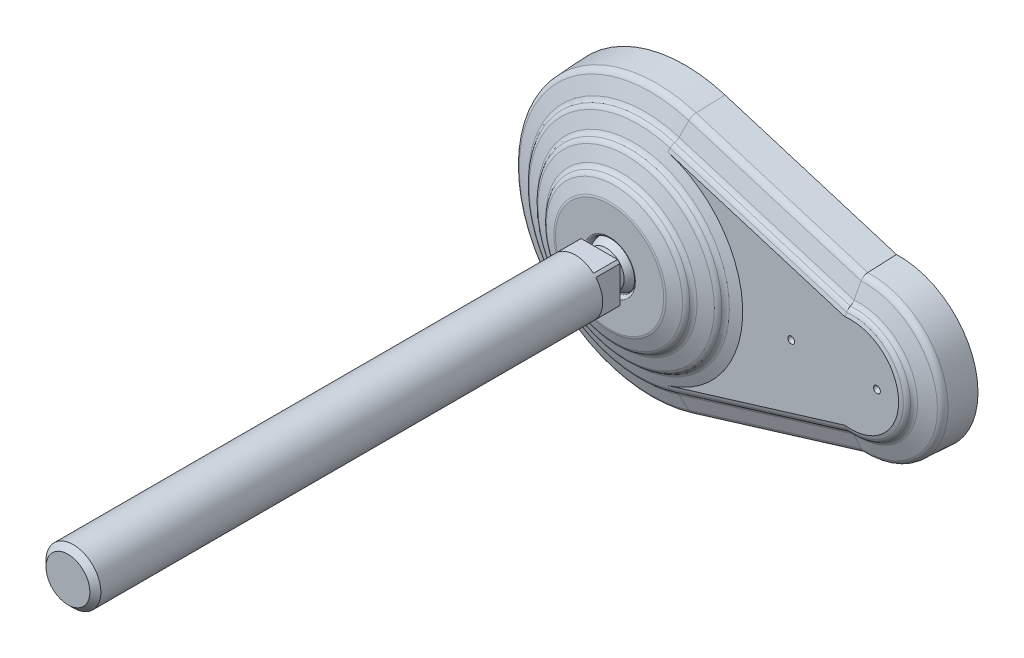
ISO-10303-21;
HEADER;
FILE_DESCRIPTION(('STEP AP214'),'2;1');
FILE_NAME('part.step','',(''),(''),'','','');
FILE_SCHEMA(('AUTOMOTIVE_DESIGN { 1 0 10303 214 1 1 1 1 }'));
ENDSEC;
DATA;
#1=APPLICATION_CONTEXT('core data for automotive mechanical design processes');
#2=APPLICATION_PROTOCOL_DEFINITION('international standard','automotive_design',2000,#1);
#3=PRODUCT_CONTEXT('',#1,'mechanical');
#4=PRODUCT('Part','Part','',(#3));
#5=PRODUCT_RELATED_PRODUCT_CATEGORY('part','',(#4));
#6=PRODUCT_DEFINITION_FORMATION('','',#4);
#7=PRODUCT_DEFINITION_CONTEXT('part definition',#1,'design');
#8=PRODUCT_DEFINITION('design','',#6,#7);
#9=PRODUCT_DEFINITION_SHAPE('','',#8);
#10=(LENGTH_UNIT() NAMED_UNIT(*) SI_UNIT(.MILLI.,.METRE.));
#11=(NAMED_UNIT(*) PLANE_ANGLE_UNIT() SI_UNIT($,.RADIAN.));
#12=(NAMED_UNIT(*) SI_UNIT($,.STERADIAN.) SOLID_ANGLE_UNIT());
#13=UNCERTAINTY_MEASURE_WITH_UNIT(LENGTH_MEASURE(1.E-05),#10,'distance_accuracy_value','');
#14=(GEOMETRIC_REPRESENTATION_CONTEXT(3) GLOBAL_UNCERTAINTY_ASSIGNED_CONTEXT((#13)) GLOBAL_UNIT_ASSIGNED_CONTEXT((#10,
#11,#12)) REPRESENTATION_CONTEXT('',''));
#15=CARTESIAN_POINT('',(0.,0.,0.));
#16=DIRECTION('',(0.,0.,1.));
#17=DIRECTION('',(1.,0.,0.));
#18=AXIS2_PLACEMENT_3D('',#15,#16,#17);
#19=CARTESIAN_POINT('',(0.,0.,34.));
#20=DIRECTION('',(0.,0.,1.));
#21=DIRECTION('',(-1.,0.,0.));
#22=AXIS2_PLACEMENT_3D('',#19,#20,#21);
#23=CYLINDRICAL_SURFACE('',#22,8.);
#24=CARTESIAN_POINT('',(0.,0.,180.4));
#25=DIRECTION('',(0.,0.,1.));
#26=DIRECTION('',(-1.,0.,0.));
#27=AXIS2_PLACEMENT_3D('',#24,#25,#26);
#28=CIRCLE('',#27,8.);
#29=CARTESIAN_POINT('',(-8.,0.,180.4));
#30=VERTEX_POINT('',#29);
#31=EDGE_CURVE('E9',#30,#30,#28,.F.);
#32=ORIENTED_EDGE('',*,*,#31,.T.);
#33=EDGE_LOOP('',(#32));
#34=FACE_BOUND('',#33,.T.);
#35=DIRECTION('',(0.,0.,1.));
#36=VECTOR('',#35,1.);
#37=CARTESIAN_POINT('',(-5.29150262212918,-6.,34.));
#38=LINE('',#37,#36);
#39=CARTESIAN_POINT('',(-5.29150262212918,-6.,34.));
#40=VERTEX_POINT('',#39);
#41=CARTESIAN_POINT('',(-5.29150262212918,-6.,27.));
#42=VERTEX_POINT('',#41);
#43=EDGE_CURVE('E415',#40,#42,#38,.F.);
#44=ORIENTED_EDGE('',*,*,#43,.F.);
#45=CARTESIAN_POINT('',(0.,0.,34.));
#46=DIRECTION('',(0.,0.,1.));
#47=DIRECTION('',(0.,-1.,0.));
#48=AXIS2_PLACEMENT_3D('',#45,#46,#47);
#49=CIRCLE('',#48,8.);
#50=CARTESIAN_POINT('',(5.29150262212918,-6.,34.));
#51=VERTEX_POINT('',#50);
#52=EDGE_CURVE('E500',#40,#51,#49,.T.);
#53=ORIENTED_EDGE('',*,*,#52,.T.);
#54=DIRECTION('',(0.,0.,1.));
#55=VECTOR('',#54,1.);
#56=CARTESIAN_POINT('',(5.29150262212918,-6.,34.));
#57=LINE('',#56,#55);
#58=CARTESIAN_POINT('',(5.29150262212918,-6.,27.));
#59=VERTEX_POINT('',#58);
#60=EDGE_CURVE('E420',#59,#51,#57,.T.);
#61=ORIENTED_EDGE('',*,*,#60,.F.);
#62=CARTESIAN_POINT('',(0.,0.,27.));
#63=DIRECTION('',(0.,0.,1.));
#64=DIRECTION('',(-1.,0.,0.));
#65=AXIS2_PLACEMENT_3D('',#62,#63,#64);
#66=CIRCLE('',#65,8.);
#67=CARTESIAN_POINT('',(6.,-5.29150262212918,27.));
#68=VERTEX_POINT('',#67);
#69=EDGE_CURVE('E533',#59,#68,#66,.T.);
#70=ORIENTED_EDGE('',*,*,#69,.T.);
#71=DIRECTION('',(0.,0.,1.));
#72=VECTOR('',#71,1.);
#73=CARTESIAN_POINT('',(6.,-5.29150262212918,34.));
#74=LINE('',#73,#72);
#75=CARTESIAN_POINT('',(6.,-5.29150262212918,34.));
#76=VERTEX_POINT('',#75);
#77=EDGE_CURVE('E423',#76,#68,#74,.F.);
#78=ORIENTED_EDGE('',*,*,#77,.F.);
#79=CARTESIAN_POINT('',(6.,5.29150262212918,34.));
#80=VERTEX_POINT('',#79);
#81=EDGE_CURVE('E417',#76,#80,#49,.T.);
#82=ORIENTED_EDGE('',*,*,#81,.T.);
#83=DIRECTION('',(0.,0.,1.));
#84=VECTOR('',#83,1.);
#85=CARTESIAN_POINT('',(6.,5.29150262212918,34.));
#86=LINE('',#85,#84);
#87=CARTESIAN_POINT('',(6.,5.29150262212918,27.));
#88=VERTEX_POINT('',#87);
#89=EDGE_CURVE('E433',#88,#80,#86,.T.);
#90=ORIENTED_EDGE('',*,*,#89,.F.);
#91=CARTESIAN_POINT('',(5.29150262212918,6.,27.));
#92=VERTEX_POINT('',#91);
#93=EDGE_CURVE('E531',#88,#92,#66,.T.);
#94=ORIENTED_EDGE('',*,*,#93,.T.);
#95=DIRECTION('',(0.,0.,1.));
#96=VECTOR('',#95,1.);
#97=CARTESIAN_POINT('',(5.29150262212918,6.,34.));
#98=LINE('',#97,#96);
#99=CARTESIAN_POINT('',(5.29150262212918,6.,34.));
#100=VERTEX_POINT('',#99);
#101=EDGE_CURVE('E436',#100,#92,#98,.F.);
#102=ORIENTED_EDGE('',*,*,#101,.F.);
#103=CARTESIAN_POINT('',(-5.29150262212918,6.,34.));
#104=VERTEX_POINT('',#103);
#105=EDGE_CURVE('E499',#100,#104,#49,.T.);
#106=ORIENTED_EDGE('',*,*,#105,.T.);
#107=DIRECTION('',(0.,0.,1.));
#108=VECTOR('',#107,1.);
#109=CARTESIAN_POINT('',(-5.29150262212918,6.,34.));
#110=LINE('',#109,#108);
#111=CARTESIAN_POINT('',(-5.29150262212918,6.,27.));
#112=VERTEX_POINT('',#111);
#113=EDGE_CURVE('E447',#112,#104,#110,.T.);
#114=ORIENTED_EDGE('',*,*,#113,.F.);
#115=CARTESIAN_POINT('',(-6.,5.29150262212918,27.));
#116=VERTEX_POINT('',#115);
#117=EDGE_CURVE('E460',#112,#116,#66,.T.);
#118=ORIENTED_EDGE('',*,*,#117,.T.);
#119=DIRECTION('',(0.,0.,1.));
#120=VECTOR('',#119,1.);
#121=CARTESIAN_POINT('',(-6.,5.29150262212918,34.));
#122=LINE('',#121,#120);
#123=CARTESIAN_POINT('',(-6.,5.29150262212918,34.));
#124=VERTEX_POINT('',#123);
#125=EDGE_CURVE('E450',#124,#116,#122,.F.);
#126=ORIENTED_EDGE('',*,*,#125,.F.);
#127=CARTESIAN_POINT('',(-6.,-5.29150262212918,34.));
#128=VERTEX_POINT('',#127);
#129=EDGE_CURVE('E493',#124,#128,#49,.T.);
#130=ORIENTED_EDGE('',*,*,#129,.T.);
#131=DIRECTION('',(0.,0.,1.));
#132=VECTOR('',#131,1.);
#133=CARTESIAN_POINT('',(-6.,-5.29150262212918,34.));
#134=LINE('',#133,#132);
#135=CARTESIAN_POINT('',(-6.,-5.29150262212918,27.));
#136=VERTEX_POINT('',#135);
#137=EDGE_CURVE('E458',#136,#128,#134,.T.);
#138=ORIENTED_EDGE('',*,*,#137,.F.);
#139=EDGE_CURVE('E404',#136,#42,#66,.T.);
#140=ORIENTED_EDGE('',*,*,#139,.T.);
#141=EDGE_LOOP('',(#44,#53,#61,#70,#78,#82,#90,#94,#102,#106,#114,#118,#126,#130,#138,#140));
#142=FACE_BOUND('',#141,.T.);
#143=ADVANCED_FACE('F15',(#34,#142),#23,.T.);
#144=CARTESIAN_POINT('',(64.1644462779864,-21.755748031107,10.3041173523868));
#145=DIRECTION('',(-0.291971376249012,0.9549953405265,-0.0523126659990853));
#146=DIRECTION('',(-0.956304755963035,-0.292371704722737,0.));
#147=AXIS2_PLACEMENT_3D('',#144,#145,#146);
#148=PLANE('',#147);
#149=CARTESIAN_POINT('',(61.6406997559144,-22.5273238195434,10.3043173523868));
#150=CARTESIAN_POINT('',(61.6501805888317,-22.600242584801,8.92023165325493));
#151=CARTESIAN_POINT('',(61.6596900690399,-22.6731526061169,7.53614569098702));
#152=CARTESIAN_POINT('',(61.6787663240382,-22.8189551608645,4.76797324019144));
#153=CARTESIAN_POINT('',(61.6883330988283,-22.8918476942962,3.38388675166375));
#154=CARTESIAN_POINT('',(61.6979285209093,-22.9647314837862,1.9998));
#155=B_SPLINE_CURVE_WITH_KNOTS('',3,(#149,#150,#151,#152,#153,#154),.UNSPECIFIED.,.F.,.F.,(4,2,
4),(0.,4.15811282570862,8.31622565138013),.UNSPECIFIED.);
#156=CARTESIAN_POINT('',(61.6407011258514,-22.5273343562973,10.3041173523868));
#157=VERTEX_POINT('',#156);
#158=CARTESIAN_POINT('',(61.697927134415,-22.9647209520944,2.));
#159=VERTEX_POINT('',#158);
#160=EDGE_CURVE('E1095',#157,#159,#155,.T.);
#161=ORIENTED_EDGE('',*,*,#160,.F.);
#162=DIRECTION('',(-0.956304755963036,-0.292371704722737,0.));
#163=VECTOR('',#162,1.);
#164=CARTESIAN_POINT('',(64.1644462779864,-21.755748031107,10.3041173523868));
#165=LINE('',#164,#163);
#166=CARTESIAN_POINT('',(11.5676847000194,-37.8361917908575,10.3041173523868));
#167=VERTEX_POINT('',#166);
#168=EDGE_CURVE('E1156',#157,#167,#165,.T.);
#169=ORIENTED_EDGE('',*,*,#168,.T.);
#170=DIRECTION('',(-0.0152947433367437,0.050026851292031,0.998630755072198));
#171=VECTOR('',#170,1.);
#172=CARTESIAN_POINT('',(11.6948681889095,-38.2521902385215,2.));
#173=LINE('',#172,#171);
#174=CARTESIAN_POINT('',(11.6948681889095,-38.2521902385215,2.));
#175=VERTEX_POINT('',#174);
#176=EDGE_CURVE('E1166',#175,#167,#173,.T.);
#177=ORIENTED_EDGE('',*,*,#176,.F.);
#178=DIRECTION('',(-0.956304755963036,-0.292371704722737,0.));
#179=VECTOR('',#178,1.);
#180=CARTESIAN_POINT('',(64.2916297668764,-22.1717464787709,2.));
#181=LINE('',#180,#179);
#182=EDGE_CURVE('E186',#159,#175,#181,.T.);
#183=ORIENTED_EDGE('',*,*,#182,.F.);
#184=EDGE_LOOP('',(#161,#169,#177,#183));
#185=FACE_BOUND('',#184,.T.);
#186=ADVANCED_FACE('F353',(#185),#148,.F.);
#187=CARTESIAN_POINT('',(61.6120778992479,-13.407327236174,16.));
#188=DIRECTION('',(-0.102070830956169,0.333858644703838,-0.937080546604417));
#189=DIRECTION('',(0.,0.942000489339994,0.335611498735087));
#190=AXIS2_PLACEMENT_3D('',#187,#188,#189);
#191=PLANE('',#190);
#192=CARTESIAN_POINT('',(60.6773763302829,-13.6925328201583,16.0002));
#193=CARTESIAN_POINT('',(60.6914441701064,-13.863175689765,15.9378718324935));
#194=CARTESIAN_POINT('',(60.7058313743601,-14.0337829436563,15.8755215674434));
#195=CARTESIAN_POINT('',(60.735244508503,-14.3749261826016,15.7507768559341));
#196=CARTESIAN_POINT('',(60.750270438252,-14.5454621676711,15.6883824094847));
#197=CARTESIAN_POINT('',(60.7656157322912,-14.7159625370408,15.6259658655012));
#198=B_SPLINE_CURVE_WITH_KNOTS('',3,(#192,#193,#194,#195,#196,#197),.UNSPECIFIED.,.F.,.F.,(4,2,
4),(0.,0.546637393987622,1.09327466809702),.UNSPECIFIED.);
#199=CARTESIAN_POINT('',(60.677421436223,-13.6930803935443,16.));
#200=VERTEX_POINT('',#199);
#201=CARTESIAN_POINT('',(60.765566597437,-14.7154161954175,15.6261658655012));
#202=VERTEX_POINT('',#201);
#203=EDGE_CURVE('E166',#200,#202,#198,.T.);
#204=ORIENTED_EDGE('',*,*,#203,.F.);
#205=DIRECTION('',(-0.956304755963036,-0.292371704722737,0.));
#206=VECTOR('',#205,1.);
#207=CARTESIAN_POINT('',(61.6120778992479,-13.407327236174,16.));
#208=LINE('',#207,#206);
#209=CARTESIAN_POINT('',(9.01531632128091,-29.4877709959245,16.));
#210=VERTEX_POINT('',#209);
#211=EDGE_CURVE('E170',#200,#210,#208,.T.);
#212=ORIENTED_EDGE('',*,*,#211,.T.);
#213=DIRECTION('',(-0.273975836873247,0.896134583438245,0.349113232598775));
#214=VECTOR('',#213,1.);
#215=CARTESIAN_POINT('',(9.30869253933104,-30.4473613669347,15.6261658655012));
#216=LINE('',#215,#214);
#217=CARTESIAN_POINT('',(9.30869253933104,-30.4473613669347,15.6261658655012));
#218=VERTEX_POINT('',#217);
#219=EDGE_CURVE('E1181',#218,#210,#216,.T.);
#220=ORIENTED_EDGE('',*,*,#219,.F.);
#221=DIRECTION('',(-0.956304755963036,-0.292371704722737,0.));
#222=VECTOR('',#221,1.);
#223=CARTESIAN_POINT('',(61.905454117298,-14.3669176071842,15.6261658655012));
#224=LINE('',#223,#222);
#225=EDGE_CURVE('E172',#202,#218,#224,.T.);
#226=ORIENTED_EDGE('',*,*,#225,.F.);
#227=EDGE_LOOP('',(#204,#212,#220,#226));
#228=FACE_BOUND('',#227,.T.);
#229=ADVANCED_FACE('F168',(#228),#191,.F.);
#230=CARTESIAN_POINT('',(62.7507979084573,-17.131912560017,15.5370123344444));
#231=DIRECTION('',(-0.956304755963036,-0.292371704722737,0.));
#232=DIRECTION('',(0.292371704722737,-0.956304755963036,0.));
#233=AXIS2_PLACEMENT_3D('',#230,#231,#232);
#234=CYLINDRICAL_SURFACE('',#233,2.00700000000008);
#235=DIRECTION('',(-0.956304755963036,-0.292371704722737,0.));
#236=VECTOR('',#235,1.);
#237=CARTESIAN_POINT('',(62.545973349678,-16.4619616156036,13.656251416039));
#238=LINE('',#237,#236);
#239=CARTESIAN_POINT('',(60.9818619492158,-16.9401584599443,13.656251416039));
#240=VERTEX_POINT('',#239);
#241=CARTESIAN_POINT('',(9.949211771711,-32.5424053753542,13.656251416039));
#242=VERTEX_POINT('',#241);
#243=EDGE_CURVE('E1160',#240,#242,#238,.T.);
#244=ORIENTED_EDGE('',*,*,#243,.F.);
#245=CARTESIAN_POINT('',(60.9819185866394,-16.9407028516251,13.656051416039));
#246=CARTESIAN_POINT('',(60.9763282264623,-16.8869710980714,13.675784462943));
#247=CARTESIAN_POINT('',(60.9708503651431,-16.8340792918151,13.697757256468));
#248=CARTESIAN_POINT('',(60.9601474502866,-16.7302929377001,13.7460604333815));
#249=CARTESIAN_POINT('',(60.9549224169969,-16.6793985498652,13.77239116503));
#250=CARTESIAN_POINT('',(60.9396574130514,-16.5300811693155,13.8578002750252));
#251=CARTESIAN_POINT('',(60.9300410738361,-16.4351542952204,13.9232476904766));
#252=CARTESIAN_POINT('',(60.9121877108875,-16.2575900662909,14.0693279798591));
#253=CARTESIAN_POINT('',(60.903952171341,-16.1749659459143,14.1499769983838));
#254=CARTESIAN_POINT('',(60.8890756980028,-16.0247595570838,14.3241094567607));
#255=CARTESIAN_POINT('',(60.8824301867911,-15.9571341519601,14.4175548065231));
#256=CARTESIAN_POINT('',(60.8754548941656,-15.8858007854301,14.5364334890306));
#257=CARTESIAN_POINT('',(60.8742920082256,-15.8738939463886,14.5571086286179));
#258=CARTESIAN_POINT('',(60.8720425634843,-15.8508368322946,14.59885583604));
#259=CARTESIAN_POINT('',(60.8709559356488,-15.839685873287,14.6199275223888));
#260=CARTESIAN_POINT('',(60.869906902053,-15.8289098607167,14.6412000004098));
#261=B_SPLINE_CURVE_WITH_KNOTS('',3,(#245,#246,#247,#248,#249,#250,#251,#252,#253,#254,#255,
#256,#257,#258,#259,#260),.UNSPECIFIED.,.F.,.F.,(4,2,2,2,2,2,2,4),(0.,0.172434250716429,
0.344882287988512,0.690191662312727,1.0358698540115,1.38054058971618,1.4521941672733,
1.52378201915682),.UNSPECIFIED.);
#262=CARTESIAN_POINT('',(60.8699167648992,-15.8290111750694,14.6410000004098));
#263=VERTEX_POINT('',#262);
#264=EDGE_CURVE('E278',#240,#263,#261,.T.);
#265=ORIENTED_EDGE('',*,*,#264,.T.);
#266=DIRECTION('',(-0.956304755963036,-0.292371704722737,0.));
#267=VECTOR('',#266,1.);
#268=CARTESIAN_POINT('',(62.2257313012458,-15.4144970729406,14.6410000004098));
#269=LINE('',#268,#267);
#270=CARTESIAN_POINT('',(9.62896972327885,-31.4949408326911,14.6410000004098));
#271=VERTEX_POINT('',#270);
#272=EDGE_CURVE('E1162',#263,#271,#269,.T.);
#273=ORIENTED_EDGE('',*,*,#272,.T.);
#274=CARTESIAN_POINT('',(10.1540363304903,-33.2123563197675,15.5370123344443));
#275=DIRECTION('',(0.956304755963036,0.292371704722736,0.));
#276=DIRECTION('',(-0.292371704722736,0.956304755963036,0.));
#277=AXIS2_PLACEMENT_3D('',#274,#275,#276);
#278=CIRCLE('',#277,2.00700000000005);
#279=EDGE_CURVE('E1175',#242,#271,#278,.T.);
#280=ORIENTED_EDGE('',*,*,#279,.F.);
#281=EDGE_LOOP('',(#244,#265,#273,#280));
#282=FACE_BOUND('',#281,.T.);
#283=ADVANCED_FACE('F330',(#282),#234,.F.);
#284=CARTESIAN_POINT('',(62.545973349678,-16.4619616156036,13.656251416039));
#285=DIRECTION('',(-0.102055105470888,0.333807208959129,-0.937100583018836));
#286=DIRECTION('',(0.,0.942019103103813,0.335559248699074));
#287=AXIS2_PLACEMENT_3D('',#284,#285,#286);
#288=PLANE('',#287);
#289=CARTESIAN_POINT('',(60.9818053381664,-16.9396143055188,13.656451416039));
#290=CARTESIAN_POINT('',(61.0189355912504,-17.2964789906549,13.5252879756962));
#291=CARTESIAN_POINT('',(61.0571375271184,-17.653206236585,13.3940567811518));
#292=CARTESIAN_POINT('',(61.1355151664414,-18.3663907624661,13.1314756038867));
#293=CARTESIAN_POINT('',(61.1756908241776,-18.7228480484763,13.0001256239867));
#294=CARTESIAN_POINT('',(61.2578477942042,-19.435511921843,12.7373183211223));
#295=CARTESIAN_POINT('',(61.2998290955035,-19.7917185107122,12.6058609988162));
#296=CARTESIAN_POINT('',(61.3854616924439,-20.5039033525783,12.3428458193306));
#297=CARTESIAN_POINT('',(61.4291130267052,-20.8598816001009,12.2112879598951));
#298=CARTESIAN_POINT('',(61.4735304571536,-21.2157475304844,12.0796866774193));
#299=B_SPLINE_CURVE_WITH_KNOTS('',3,(#289,#290,#291,#292,#293,#294,#295,#296,#297,#298),
.UNSPECIFIED.,.F.,.F.,(4,2,2,2,4),(0.,1.14603990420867,2.29205327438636,3.43805966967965,
4.58409258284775),.UNSPECIFIED.);
#300=CARTESIAN_POINT('',(61.4734629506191,-21.2152067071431,12.0798866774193));
#301=VERTEX_POINT('',#300);
#302=EDGE_CURVE('E311',#240,#301,#299,.T.);
#303=ORIENTED_EDGE('',*,*,#302,.F.);
#304=ORIENTED_EDGE('',*,*,#243,.T.);
#305=DIRECTION('',(-0.273981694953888,0.896153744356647,0.349059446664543));
#306=VECTOR('',#305,1.);
#307=CARTESIAN_POINT('',(11.1865227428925,-36.5894672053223,12.0798866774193));
#308=LINE('',#307,#306);
#309=CARTESIAN_POINT('',(11.1865227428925,-36.5894672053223,12.0798866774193));
#310=VERTEX_POINT('',#309);
#311=EDGE_CURVE('E1172',#310,#242,#308,.T.);
#312=ORIENTED_EDGE('',*,*,#311,.F.);
#313=DIRECTION('',(-0.956304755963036,-0.292371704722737,0.));
#314=VECTOR('',#313,1.);
#315=CARTESIAN_POINT('',(63.7832843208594,-20.5090234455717,12.0798866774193));
#316=LINE('',#315,#314);
#317=EDGE_CURVE('E1158',#301,#310,#316,.T.);
#318=ORIENTED_EDGE('',*,*,#317,.F.);
#319=EDGE_LOOP('',(#303,#304,#312,#318));
#320=FACE_BOUND('',#319,.T.);
#321=ADVANCED_FACE('F325',(#320),#288,.F.);
#322=CARTESIAN_POINT('',(64.2916297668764,22.1717464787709,2.));
#323=DIRECTION('',(-0.291971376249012,-0.9549953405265,-0.0523126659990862));
#324=DIRECTION('',(0.956304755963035,-0.292371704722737,0.));
#325=AXIS2_PLACEMENT_3D('',#322,#323,#324);
#326=PLANE('',#325);
#327=CARTESIAN_POINT('',(61.6979285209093,22.9647314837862,1.9998));
#328=CARTESIAN_POINT('',(61.6883330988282,22.8918476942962,3.38388675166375));
#329=CARTESIAN_POINT('',(61.6787663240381,22.8189551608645,4.76797324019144));
#330=CARTESIAN_POINT('',(61.6596900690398,22.6731526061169,7.53614569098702));
#331=CARTESIAN_POINT('',(61.6501805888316,22.600242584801,8.92023165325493));
#332=CARTESIAN_POINT('',(61.6406997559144,22.5273238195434,10.3043173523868));
#333=B_SPLINE_CURVE_WITH_KNOTS('',3,(#327,#328,#329,#330,#331,#332),.UNSPECIFIED.,.F.,.F.,(4,2,
4),(0.,4.15811282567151,8.31622565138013),.UNSPECIFIED.);
#334=CARTESIAN_POINT('',(61.6979271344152,22.9647209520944,2.));
#335=VERTEX_POINT('',#334);
#336=CARTESIAN_POINT('',(61.6407011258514,22.5273343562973,10.3041173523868));
#337=VERTEX_POINT('',#336);
#338=EDGE_CURVE('E1088',#335,#337,#333,.T.);
#339=ORIENTED_EDGE('',*,*,#338,.F.);
#340=DIRECTION('',(-0.956304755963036,0.292371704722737,0.));
#341=VECTOR('',#340,1.);
#342=CARTESIAN_POINT('',(64.2916297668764,22.1717464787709,2.));
#343=LINE('',#342,#341);
#344=CARTESIAN_POINT('',(11.6948681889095,38.2521902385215,2.));
#345=VERTEX_POINT('',#344);
#346=EDGE_CURVE('E1154',#335,#345,#343,.T.);
#347=ORIENTED_EDGE('',*,*,#346,.T.);
#348=DIRECTION('',(-0.0152947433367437,-0.050026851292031,0.998630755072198));
#349=VECTOR('',#348,1.);
#350=CARTESIAN_POINT('',(11.6948681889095,38.2521902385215,2.));
#351=LINE('',#350,#349);
#352=CARTESIAN_POINT('',(11.5676847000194,37.8361917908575,10.3041173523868));
#353=VERTEX_POINT('',#352);
#354=EDGE_CURVE('E1183',#345,#353,#351,.T.);
#355=ORIENTED_EDGE('',*,*,#354,.T.);
#356=DIRECTION('',(-0.956304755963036,0.292371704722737,0.));
#357=VECTOR('',#356,1.);
#358=CARTESIAN_POINT('',(64.1644462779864,21.755748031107,10.3041173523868));
#359=LINE('',#358,#357);
#360=EDGE_CURVE('E1152',#337,#353,#359,.T.);
#361=ORIENTED_EDGE('',*,*,#360,.F.);
#362=EDGE_LOOP('',(#339,#347,#355,#361));
#363=FACE_BOUND('',#362,.T.);
#364=ADVANCED_FACE('F329',(#363),#326,.F.);
#365=CARTESIAN_POINT('',(63.7832843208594,20.5090234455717,12.0798866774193));
#366=DIRECTION('',(-0.102055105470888,-0.333807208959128,-0.937100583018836));
#367=DIRECTION('',(0.,0.942019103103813,-0.335559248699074));
#368=AXIS2_PLACEMENT_3D('',#365,#366,#367);
#369=PLANE('',#368);
#370=CARTESIAN_POINT('',(61.4735304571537,21.2157475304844,12.0796866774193));
#371=CARTESIAN_POINT('',(61.4291130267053,20.8598816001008,12.2112879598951));
#372=CARTESIAN_POINT('',(61.3854616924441,20.5039033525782,12.3428458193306));
#373=CARTESIAN_POINT('',(61.2998290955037,19.7917185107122,12.6058609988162));
#374=CARTESIAN_POINT('',(61.2578477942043,19.435511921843,12.7373183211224));
#375=CARTESIAN_POINT('',(61.1756908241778,18.7228480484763,13.0001256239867));
#376=CARTESIAN_POINT('',(61.1355151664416,18.3663907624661,13.1314756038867));
#377=CARTESIAN_POINT('',(61.0571375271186,17.653206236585,13.3940567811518));
#378=CARTESIAN_POINT('',(61.0189355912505,17.2964789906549,13.5252879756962));
#379=CARTESIAN_POINT('',(60.9818053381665,16.9396143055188,13.656451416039));
#380=B_SPLINE_CURVE_WITH_KNOTS('',3,(#370,#371,#372,#373,#374,#375,#376,#377,#378,#379),
.UNSPECIFIED.,.F.,.F.,(4,2,2,2,4),(0.,1.14603291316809,2.29203930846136,3.43805267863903,
4.58409258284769),.UNSPECIFIED.);
#381=CARTESIAN_POINT('',(61.4734629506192,21.2152067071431,12.0798866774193));
#382=VERTEX_POINT('',#381);
#383=CARTESIAN_POINT('',(60.9818619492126,16.9401584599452,13.656251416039));
#384=VERTEX_POINT('',#383);
#385=EDGE_CURVE('E305',#382,#384,#380,.T.);
#386=ORIENTED_EDGE('',*,*,#385,.F.);
#387=DIRECTION('',(-0.956304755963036,0.292371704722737,0.));
#388=VECTOR('',#387,1.);
#389=CARTESIAN_POINT('',(63.7832843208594,20.5090234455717,12.0798866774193));
#390=LINE('',#389,#388);
#391=CARTESIAN_POINT('',(11.1865227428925,36.5894672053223,12.0798866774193));
#392=VERTEX_POINT('',#391);
#393=EDGE_CURVE('E1150',#382,#392,#390,.T.);
#394=ORIENTED_EDGE('',*,*,#393,.T.);
#395=DIRECTION('',(-0.273981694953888,-0.896153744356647,0.349059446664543));
#396=VECTOR('',#395,1.);
#397=CARTESIAN_POINT('',(11.1865227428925,36.5894672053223,12.0798866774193));
#398=LINE('',#397,#396);
#399=CARTESIAN_POINT('',(9.949211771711,32.5424053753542,13.656251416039));
#400=VERTEX_POINT('',#399);
#401=EDGE_CURVE('E1189',#392,#400,#398,.T.);
#402=ORIENTED_EDGE('',*,*,#401,.T.);
#403=DIRECTION('',(-0.956304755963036,0.292371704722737,0.));
#404=VECTOR('',#403,1.);
#405=CARTESIAN_POINT('',(62.545973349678,16.4619616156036,13.656251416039));
#406=LINE('',#405,#404);
#407=EDGE_CURVE('E1148',#384,#400,#406,.T.);
#408=ORIENTED_EDGE('',*,*,#407,.F.);
#409=EDGE_LOOP('',(#386,#394,#402,#408));
#410=FACE_BOUND('',#409,.T.);
#411=ADVANCED_FACE('F266',(#410),#369,.F.);
#412=CARTESIAN_POINT('',(62.7507979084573,17.1319125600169,15.5370123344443));
#413=DIRECTION('',(-0.956304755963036,0.292371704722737,0.));
#414=DIRECTION('',(-0.292371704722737,-0.956304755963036,0.));
#415=AXIS2_PLACEMENT_3D('',#412,#413,#414);
#416=CYLINDRICAL_SURFACE('',#415,2.007);
#417=DIRECTION('',(-0.956304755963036,0.292371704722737,0.));
#418=VECTOR('',#417,1.);
#419=CARTESIAN_POINT('',(62.2257313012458,15.4144970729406,14.6410000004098));
#420=LINE('',#419,#418);
#421=CARTESIAN_POINT('',(60.8699167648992,15.8290111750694,14.6410000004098));
#422=VERTEX_POINT('',#421);
#423=CARTESIAN_POINT('',(9.62896972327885,31.4949408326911,14.6410000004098));
#424=VERTEX_POINT('',#423);
#425=EDGE_CURVE('E1146',#422,#424,#420,.T.);
#426=ORIENTED_EDGE('',*,*,#425,.F.);
#427=CARTESIAN_POINT('',(60.869906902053,15.8289098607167,14.6412000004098));
#428=CARTESIAN_POINT('',(60.8724049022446,15.8545692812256,14.5905409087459));
#429=CARTESIAN_POINT('',(60.8751177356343,15.882373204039,14.5410120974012));
#430=CARTESIAN_POINT('',(60.8809599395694,15.9420653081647,14.4445128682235));
#431=CARTESIAN_POINT('',(60.8840892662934,15.9739530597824,14.3975421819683));
#432=CARTESIAN_POINT('',(60.8940798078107,16.0754098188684,14.2609440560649));
#433=CARTESIAN_POINT('',(60.9015461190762,16.1507985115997,14.1755790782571));
#434=CARTESIAN_POINT('',(60.9179069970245,16.3146445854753,14.0187596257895));
#435=CARTESIAN_POINT('',(60.9268017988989,16.4031041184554,13.9473074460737));
#436=CARTESIAN_POINT('',(60.9458071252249,16.5904449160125,13.8202080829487));
#437=CARTESIAN_POINT('',(60.9559150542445,16.6893038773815,13.7645279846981));
#438=CARTESIAN_POINT('',(60.9690169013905,16.8162843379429,13.7062217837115));
#439=CARTESIAN_POINT('',(60.9715630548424,16.8409104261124,13.6954970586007));
#440=CARTESIAN_POINT('',(60.9767040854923,16.8905299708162,13.6750365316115));
#441=CARTESIAN_POINT('',(60.9792989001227,16.9155229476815,13.6652995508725));
#442=CARTESIAN_POINT('',(60.9819185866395,16.940702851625,13.656051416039));
#443=B_SPLINE_CURVE_WITH_KNOTS('',3,(#427,#428,#429,#430,#431,#432,#433,#434,#435,#436,#437,
#438,#439,#440,#441,#442),.UNSPECIFIED.,.F.,.F.,(4,2,2,2,2,2,2,4),(0.,0.170415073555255,
0.340812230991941,0.68143537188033,1.0221146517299,1.36207763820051,1.44300799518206,
1.52384059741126),.UNSPECIFIED.);
#444=EDGE_CURVE('E271',#422,#384,#443,.T.);
#445=ORIENTED_EDGE('',*,*,#444,.T.);
#446=ORIENTED_EDGE('',*,*,#407,.T.);
#447=CARTESIAN_POINT('',(10.1540363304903,33.2123563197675,15.5370123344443));
#448=DIRECTION('',(-0.956304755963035,0.292371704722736,0.));
#449=DIRECTION('',(-0.292371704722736,-0.956304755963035,0.));
#450=AXIS2_PLACEMENT_3D('',#447,#448,#449);
#451=CIRCLE('',#450,2.00700000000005);
#452=EDGE_CURVE('E1192',#400,#424,#451,.T.);
#453=ORIENTED_EDGE('',*,*,#452,.T.);
#454=EDGE_LOOP('',(#426,#445,#446,#453));
#455=FACE_BOUND('',#454,.T.);
#456=ADVANCED_FACE('F253',(#455),#416,.F.);
#457=CARTESIAN_POINT('',(61.905454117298,14.3669176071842,15.6261658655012));
#458=DIRECTION('',(-0.102070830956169,-0.333858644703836,-0.937080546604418));
#459=DIRECTION('',(0.,0.942000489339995,-0.335611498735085));
#460=AXIS2_PLACEMENT_3D('',#457,#458,#459);
#461=PLANE('',#460);
#462=CARTESIAN_POINT('',(60.7656157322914,14.7159625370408,15.6259658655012));
#463=CARTESIAN_POINT('',(60.750270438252,14.5454621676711,15.6883824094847));
#464=CARTESIAN_POINT('',(60.7352445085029,14.3749261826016,15.7507768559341));
#465=CARTESIAN_POINT('',(60.70583137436,14.0337829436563,15.8755215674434));
#466=CARTESIAN_POINT('',(60.6914441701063,13.863175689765,15.9378718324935));
#467=CARTESIAN_POINT('',(60.6773763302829,13.6925328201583,16.0002));
#468=B_SPLINE_CURVE_WITH_KNOTS('',3,(#462,#463,#464,#465,#466,#467),.UNSPECIFIED.,.F.,.F.,(4,2,
4),(0.,0.546637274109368,1.09327466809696),.UNSPECIFIED.);
#469=CARTESIAN_POINT('',(60.7655665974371,14.7154161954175,15.6261658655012));
#470=VERTEX_POINT('',#469);
#471=CARTESIAN_POINT('',(60.6774214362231,13.6930803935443,16.));
#472=VERTEX_POINT('',#471);
#473=EDGE_CURVE('E191',#470,#472,#468,.T.);
#474=ORIENTED_EDGE('',*,*,#473,.F.);
#475=DIRECTION('',(-0.956304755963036,0.292371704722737,0.));
#476=VECTOR('',#475,1.);
#477=CARTESIAN_POINT('',(61.905454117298,14.3669176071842,15.6261658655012));
#478=LINE('',#477,#476);
#479=CARTESIAN_POINT('',(9.30869253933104,30.4473613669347,15.6261658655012));
#480=VERTEX_POINT('',#479);
#481=EDGE_CURVE('E1144',#470,#480,#478,.T.);
#482=ORIENTED_EDGE('',*,*,#481,.T.);
#483=DIRECTION('',(-0.273975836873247,-0.896134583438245,0.349113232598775));
#484=VECTOR('',#483,1.);
#485=CARTESIAN_POINT('',(9.30869253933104,30.4473613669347,15.6261658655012));
#486=LINE('',#485,#484);
#487=CARTESIAN_POINT('',(9.01531632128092,29.4877709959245,16.));
#488=VERTEX_POINT('',#487);
#489=EDGE_CURVE('E1198',#480,#488,#486,.T.);
#490=ORIENTED_EDGE('',*,*,#489,.T.);
#491=DIRECTION('',(-0.956304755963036,0.292371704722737,0.));
#492=VECTOR('',#491,1.);
#493=CARTESIAN_POINT('',(61.6120778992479,13.4073272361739,16.));
#494=LINE('',#493,#492);
#495=EDGE_CURVE('E1142',#472,#488,#494,.T.);
#496=ORIENTED_EDGE('',*,*,#495,.F.);
#497=EDGE_LOOP('',(#474,#482,#490,#496));
#498=FACE_BOUND('',#497,.T.);
#499=ADVANCED_FACE('F248',(#498),#461,.F.);
#500=CARTESIAN_POINT('',(0.,0.,2.));
#501=DIRECTION('',(0.,0.,1.));
#502=DIRECTION('',(-1.,0.,0.));
#503=AXIS2_PLACEMENT_3D('',#500,#501,#502);
#504=PLANE('',#503);
#505=ORIENTED_EDGE('',*,*,#346,.F.);
#506=CARTESIAN_POINT('',(62.5,0.,2.));
#507=DIRECTION('',(0.,0.,1.));
#508=DIRECTION('',(0.,-1.,0.));
#509=AXIS2_PLACEMENT_3D('',#506,#507,#508);
#510=CIRCLE('',#509,22.9787234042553);
#511=EDGE_CURVE('E177',#159,#335,#510,.T.);
#512=ORIENTED_EDGE('',*,*,#511,.F.);
#513=ORIENTED_EDGE('',*,*,#182,.T.);
#514=CARTESIAN_POINT('',(0.,0.,2.));
#515=DIRECTION('',(0.,0.,1.));
#516=DIRECTION('',(-1.,0.,0.));
#517=AXIS2_PLACEMENT_3D('',#514,#515,#516);
#518=CIRCLE('',#517,40.);
#519=EDGE_CURVE('E244',#345,#175,#518,.T.);
#520=ORIENTED_EDGE('',*,*,#519,.F.);
#521=EDGE_LOOP('',(#505,#512,#513,#520));
#522=FACE_BOUND('',#521,.T.);
#523=CARTESIAN_POINT('',(65.,0.,2.));
#524=DIRECTION('',(0.,0.,1.));
#525=DIRECTION('',(1.,0.,0.));
#526=AXIS2_PLACEMENT_3D('',#523,#524,#525);
#527=CIRCLE('',#526,16.);
#528=CARTESIAN_POINT('',(69.9230769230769,-15.2237746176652,2.));
#529=VERTEX_POINT('',#528);
#530=CARTESIAN_POINT('',(69.9230769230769,15.2237746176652,2.));
#531=VERTEX_POINT('',#530);
#532=EDGE_CURVE('E568',#529,#531,#527,.T.);
#533=ORIENTED_EDGE('',*,*,#532,.T.);
#534=DIRECTION('',(-0.951485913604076,0.307692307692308,0.));
#535=VECTOR('',#534,1.);
#536=CARTESIAN_POINT('',(69.9230769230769,15.2237746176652,2.));
#537=LINE('',#536,#535);
#538=CARTESIAN_POINT('',(11.0769230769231,34.2534928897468,2.));
#539=VERTEX_POINT('',#538);
#540=EDGE_CURVE('E32',#531,#539,#537,.T.);
#541=ORIENTED_EDGE('',*,*,#540,.T.);
#542=CARTESIAN_POINT('',(0.,0.,2.));
#543=DIRECTION('',(0.,0.,1.));
#544=DIRECTION('',(1.,0.,0.));
#545=AXIS2_PLACEMENT_3D('',#542,#543,#544);
#546=CIRCLE('',#545,36.);
#547=CARTESIAN_POINT('',(11.0769230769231,-34.2534928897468,2.));
#548=VERTEX_POINT('',#547);
#549=EDGE_CURVE('E575',#539,#548,#546,.T.);
#550=ORIENTED_EDGE('',*,*,#549,.T.);
#551=DIRECTION('',(0.951485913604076,0.307692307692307,0.));
#552=VECTOR('',#551,1.);
#553=CARTESIAN_POINT('',(11.0769230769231,-34.2534928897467,2.));
#554=LINE('',#553,#552);
#555=EDGE_CURVE('E570',#548,#529,#554,.T.);
#556=ORIENTED_EDGE('',*,*,#555,.T.);
#557=EDGE_LOOP('',(#533,#541,#550,#556));
#558=FACE_BOUND('',#557,.T.);
#559=ADVANCED_FACE('F252',(#522,#558),#504,.F.);
#560=CARTESIAN_POINT('',(0.,0.,2.));
#561=DIRECTION('',(0.,0.,-1.));
#562=DIRECTION('',(1.,0.,0.));
#563=AXIS2_PLACEMENT_3D('',#560,#561,#562);
#564=CONICAL_SURFACE('',#563,40.,0.0523365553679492);
#565=CARTESIAN_POINT('',(0.,0.,10.3041173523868));
#566=DIRECTION('',(0.,0.,1.));
#567=DIRECTION('',(-1.,0.,0.));
#568=AXIS2_PLACEMENT_3D('',#565,#566,#567);
#569=CIRCLE('',#568,39.5649938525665);
#570=EDGE_CURVE('E1212',#353,#167,#569,.T.);
#571=ORIENTED_EDGE('',*,*,#570,.F.);
#572=ORIENTED_EDGE('',*,*,#354,.F.);
#573=ORIENTED_EDGE('',*,*,#519,.T.);
#574=ORIENTED_EDGE('',*,*,#176,.T.);
#575=EDGE_LOOP('',(#571,#572,#573,#574));
#576=FACE_BOUND('',#575,.T.);
#577=ADVANCED_FACE('F1000',(#576),#564,.T.);
#578=CARTESIAN_POINT('',(0.,0.,10.1991258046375));
#579=DIRECTION('',(0.,0.,1.));
#580=DIRECTION('',(-1.,0.,0.));
#581=AXIS2_PLACEMENT_3D('',#578,#579,#580);
#582=TOROIDAL_SURFACE('',#581,37.5607419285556,2.007);
#583=CARTESIAN_POINT('',(0.,0.,12.0798866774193));
#584=DIRECTION('',(0.,0.,1.));
#585=DIRECTION('',(-1.,0.,0.));
#586=AXIS2_PLACEMENT_3D('',#583,#584,#585);
#587=CIRCLE('',#586,38.2613042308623);
#588=EDGE_CURVE('E1210',#392,#310,#587,.T.);
#589=ORIENTED_EDGE('',*,*,#588,.F.);
#590=CARTESIAN_POINT('',(10.9816981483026,35.9195161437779,10.1991258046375));
#591=DIRECTION('',(-0.956304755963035,0.292371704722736,0.));
#592=DIRECTION('',(-0.292371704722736,-0.956304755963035,0.));
#593=AXIS2_PLACEMENT_3D('',#590,#591,#592);
#594=CIRCLE('',#593,2.007);
#595=EDGE_CURVE('E1186',#392,#353,#594,.T.);
#596=ORIENTED_EDGE('',*,*,#595,.T.);
#597=ORIENTED_EDGE('',*,*,#570,.T.);
#598=CARTESIAN_POINT('',(10.9816981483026,-35.9195161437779,10.1991258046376));
#599=DIRECTION('',(0.956304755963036,0.292371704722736,0.));
#600=DIRECTION('',(-0.292371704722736,0.956304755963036,0.));
#601=AXIS2_PLACEMENT_3D('',#598,#599,#600);
#602=CIRCLE('',#601,2.007);
#603=EDGE_CURVE('E1169',#310,#167,#602,.T.);
#604=ORIENTED_EDGE('',*,*,#603,.F.);
#605=EDGE_LOOP('',(#589,#596,#597,#604));
#606=FACE_BOUND('',#605,.T.);
#607=ADVANCED_FACE('F991',(#606),#582,.T.);
#608=CARTESIAN_POINT('',(0.,0.,12.0798866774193));
#609=DIRECTION('',(0.,0.,-1.));
#610=DIRECTION('',(1.,0.,0.));
#611=AXIS2_PLACEMENT_3D('',#608,#609,#610);
#612=CONICAL_SURFACE('',#611,38.2613042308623,1.21422909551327);
#613=CARTESIAN_POINT('',(0.,0.,13.656251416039));
#614=DIRECTION('',(0.,0.,1.));
#615=DIRECTION('',(-1.,0.,0.));
#616=AXIS2_PLACEMENT_3D('',#613,#614,#615);
#617=CIRCLE('',#616,34.0293250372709);
#618=EDGE_CURVE('E1207',#400,#242,#617,.T.);
#619=ORIENTED_EDGE('',*,*,#618,.F.);
#620=ORIENTED_EDGE('',*,*,#401,.F.);
#621=ORIENTED_EDGE('',*,*,#588,.T.);
#622=ORIENTED_EDGE('',*,*,#311,.T.);
#623=EDGE_LOOP('',(#619,#620,#621,#622));
#624=FACE_BOUND('',#623,.T.);
#625=ADVANCED_FACE('F982',(#624),#612,.T.);
#626=CARTESIAN_POINT('',(0.,0.,15.5370123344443));
#627=DIRECTION('',(0.,0.,1.));
#628=DIRECTION('',(-1.,0.,0.));
#629=AXIS2_PLACEMENT_3D('',#626,#627,#628);
#630=TOROIDAL_SURFACE('',#629,34.7298872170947,2.00700000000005);
#631=CARTESIAN_POINT('',(0.,0.,14.6410000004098));
#632=DIRECTION('',(0.,0.,1.));
#633=DIRECTION('',(-1.,0.,0.));
#634=AXIS2_PLACEMENT_3D('',#631,#632,#633);
#635=CIRCLE('',#634,32.9339999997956);
#636=EDGE_CURVE('E1204',#424,#271,#635,.T.);
#637=ORIENTED_EDGE('',*,*,#636,.F.);
#638=ORIENTED_EDGE('',*,*,#452,.F.);
#639=ORIENTED_EDGE('',*,*,#618,.T.);
#640=ORIENTED_EDGE('',*,*,#279,.T.);
#641=EDGE_LOOP('',(#637,#638,#639,#640));
#642=FACE_BOUND('',#641,.T.);
#643=ADVANCED_FACE('F973',(#642),#630,.F.);
#644=CARTESIAN_POINT('',(0.,0.,13.7454451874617));
#645=DIRECTION('',(0.,0.,1.));
#646=DIRECTION('',(-1.,0.,0.));
#647=AXIS2_PLACEMENT_3D('',#644,#645,#646);
#648=TOROIDAL_SURFACE('',#647,31.1378845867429,2.007);
#649=CARTESIAN_POINT('',(0.,0.,15.6261658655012));
#650=DIRECTION('',(0.,0.,1.));
#651=DIRECTION('',(-1.,0.,0.));
#652=AXIS2_PLACEMENT_3D('',#649,#650,#651);
#653=CIRCLE('',#652,31.8385547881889);
#654=EDGE_CURVE('E1201',#480,#218,#653,.T.);
#655=ORIENTED_EDGE('',*,*,#654,.F.);
#656=CARTESIAN_POINT('',(9.10383639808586,29.7773071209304,13.7454451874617));
#657=DIRECTION('',(-0.956304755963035,0.292371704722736,0.));
#658=DIRECTION('',(-0.292371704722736,-0.956304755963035,0.));
#659=AXIS2_PLACEMENT_3D('',#656,#657,#658);
#660=CIRCLE('',#659,2.007);
#661=EDGE_CURVE('E1195',#480,#424,#660,.T.);
#662=ORIENTED_EDGE('',*,*,#661,.T.);
#663=ORIENTED_EDGE('',*,*,#636,.T.);
#664=CARTESIAN_POINT('',(9.10383639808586,-29.7773071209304,13.7454451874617));
#665=DIRECTION('',(0.956304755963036,0.292371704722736,0.));
#666=DIRECTION('',(-0.292371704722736,0.956304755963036,0.));
#667=AXIS2_PLACEMENT_3D('',#664,#665,#666);
#668=CIRCLE('',#667,2.007);
#669=EDGE_CURVE('E1178',#218,#271,#668,.T.);
#670=ORIENTED_EDGE('',*,*,#669,.F.);
#671=EDGE_LOOP('',(#655,#662,#663,#670));
#672=FACE_BOUND('',#671,.T.);
#673=ADVANCED_FACE('F964',(#672),#648,.T.);
#674=CARTESIAN_POINT('',(0.,0.,15.6261658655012));
#675=DIRECTION('',(0.,0.,-1.));
#676=DIRECTION('',(1.,0.,0.));
#677=AXIS2_PLACEMENT_3D('',#674,#675,#676);
#678=CONICAL_SURFACE('',#677,31.8385547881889,1.21417169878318);
#679=CARTESIAN_POINT('',(0.,0.,17.054));
#680=DIRECTION('',(0.,0.,1.));
#681=DIRECTION('',(0.,-1.,0.));
#682=AXIS2_PLACEMENT_3D('',#679,#680,#681);
#683=CIRCLE('',#682,28.006);
#684=CARTESIAN_POINT('',(0.,-28.006,17.054));
#685=VERTEX_POINT('',#684);
#686=EDGE_CURVE('E1109',#685,#685,#683,.T.);
#687=ORIENTED_EDGE('',*,*,#686,.F.);
#688=EDGE_LOOP('',(#687));
#689=FACE_BOUND('',#688,.T.);
#690=CARTESIAN_POINT('',(0.,0.,16.));
#691=DIRECTION('',(0.,0.,1.));
#692=DIRECTION('',(0.,-1.,0.));
#693=AXIS2_PLACEMENT_3D('',#690,#691,#692);
#694=CIRCLE('',#693,30.8351190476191);
#695=EDGE_CURVE('E184',#210,#488,#694,.T.);
#696=ORIENTED_EDGE('',*,*,#695,.T.);
#697=ORIENTED_EDGE('',*,*,#489,.F.);
#698=ORIENTED_EDGE('',*,*,#654,.T.);
#699=ORIENTED_EDGE('',*,*,#219,.T.);
#700=EDGE_LOOP('',(#696,#697,#698,#699));
#701=FACE_BOUND('',#700,.T.);
#702=ADVANCED_FACE('F348',(#689,#701),#678,.T.);
#703=CARTESIAN_POINT('',(9.01531632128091,29.4877709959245,16.));
#704=DIRECTION('',(0.,0.,-1.));
#705=DIRECTION('',(1.,0.,0.));
#706=AXIS2_PLACEMENT_3D('',#703,#704,#705);
#707=PLANE('',#706);
#708=CARTESIAN_POINT('',(45.,0.,16.));
#709=DIRECTION('',(0.,0.,-1.));
#710=DIRECTION('',(0.,1.,0.));
#711=AXIS2_PLACEMENT_3D('',#708,#709,#710);
#712=CIRCLE('',#711,1.);
#713=CARTESIAN_POINT('',(45.,1.,16.));
#714=VERTEX_POINT('',#713);
#715=EDGE_CURVE('E590',#714,#714,#712,.T.);
#716=ORIENTED_EDGE('',*,*,#715,.T.);
#717=EDGE_LOOP('',(#716));
#718=FACE_BOUND('',#717,.T.);
#719=CARTESIAN_POINT('',(70.,0.,16.));
#720=DIRECTION('',(0.,0.,-1.));
#721=DIRECTION('',(0.,1.,0.));
#722=AXIS2_PLACEMENT_3D('',#719,#720,#721);
#723=CIRCLE('',#722,1.);
#724=CARTESIAN_POINT('',(70.,1.,16.));
#725=VERTEX_POINT('',#724);
#726=EDGE_CURVE('E593',#725,#725,#723,.T.);
#727=ORIENTED_EDGE('',*,*,#726,.T.);
#728=EDGE_LOOP('',(#727));
#729=FACE_BOUND('',#728,.T.);
#730=ORIENTED_EDGE('',*,*,#211,.F.);
#731=CARTESIAN_POINT('',(62.5,0.,16.));
#732=DIRECTION('',(0.,0.,1.));
#733=DIRECTION('',(0.,-1.,0.));
#734=AXIS2_PLACEMENT_3D('',#731,#732,#733);
#735=CIRCLE('',#734,13.8138424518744);
#736=EDGE_CURVE('E181',#200,#472,#735,.T.);
#737=ORIENTED_EDGE('',*,*,#736,.T.);
#738=ORIENTED_EDGE('',*,*,#495,.T.);
#739=ORIENTED_EDGE('',*,*,#695,.F.);
#740=EDGE_LOOP('',(#730,#737,#738,#739));
#741=FACE_BOUND('',#740,.T.);
#742=ADVANCED_FACE('F180',(#718,#729,#741),#707,.F.);
#743=CARTESIAN_POINT('',(61.7005979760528,-13.6968633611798,13.7454451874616));
#744=DIRECTION('',(-0.956304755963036,-0.292371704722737,0.));
#745=DIRECTION('',(0.292371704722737,-0.956304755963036,0.));
#746=AXIS2_PLACEMENT_3D('',#743,#744,#745);
#747=CYLINDRICAL_SURFACE('',#746,2.007);
#748=ORIENTED_EDGE('',*,*,#272,.F.);
#749=CARTESIAN_POINT('',(60.8699266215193,-15.8291124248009,14.6408000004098));
#750=CARTESIAN_POINT('',(60.8674327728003,-15.8034938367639,14.6914108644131));
#751=CARTESIAN_POINT('',(60.8647362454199,-15.7757317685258,14.74089344));
#752=CARTESIAN_POINT('',(60.858964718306,-15.7161228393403,14.8373036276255));
#753=CARTESIAN_POINT('',(60.8558897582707,-15.6842764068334,14.8842315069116));
#754=CARTESIAN_POINT('',(60.8461407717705,-15.5829473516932,15.0206941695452));
#755=CARTESIAN_POINT('',(60.8389394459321,-15.5076423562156,15.1059721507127));
#756=CARTESIAN_POINT('',(60.8234284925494,-15.3439431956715,15.2626343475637));
#757=CARTESIAN_POINT('',(60.8151186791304,-15.2555468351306,15.3340162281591));
#758=CARTESIAN_POINT('',(60.7977056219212,-15.0683060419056,15.4610128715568));
#759=CARTESIAN_POINT('',(60.7886040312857,-14.9694832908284,15.5166595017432));
#760=CARTESIAN_POINT('',(60.7770047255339,-14.8420034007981,15.5752115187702));
#761=CARTESIAN_POINT('',(60.7747221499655,-14.8168458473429,15.586159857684));
#762=CARTESIAN_POINT('',(60.7701357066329,-14.7661467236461,15.6070291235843));
#763=CARTESIAN_POINT('',(60.7678318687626,-14.7406056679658,15.6169513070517));
#764=CARTESIAN_POINT('',(60.7655174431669,-14.7148696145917,15.6263658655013));
#765=B_SPLINE_CURVE_WITH_KNOTS('',3,(#749,#750,#751,#752,#753,#754,#755,#756,#757,#758,#759,
#760,#761,#762,#763,#764),.UNSPECIFIED.,.F.,.F.,(4,2,2,2,2,2,2,4),(0.,0.170230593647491,
0.340443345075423,0.680655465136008,1.02092470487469,1.3604998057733,1.44308206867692,
1.52556198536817),.UNSPECIFIED.);
#766=EDGE_CURVE('E279',#263,#202,#765,.T.);
#767=ORIENTED_EDGE('',*,*,#766,.T.);
#768=ORIENTED_EDGE('',*,*,#225,.T.);
#769=ORIENTED_EDGE('',*,*,#669,.T.);
#770=EDGE_LOOP('',(#748,#767,#768,#769));
#771=FACE_BOUND('',#770,.T.);
#772=ADVANCED_FACE('F338',(#771),#747,.T.);
#773=CARTESIAN_POINT('',(63.5784597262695,-19.8390723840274,10.1991258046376));
#774=DIRECTION('',(-0.956304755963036,-0.292371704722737,0.));
#775=DIRECTION('',(0.292371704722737,-0.956304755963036,0.));
#776=AXIS2_PLACEMENT_3D('',#773,#774,#775);
#777=CYLINDRICAL_SURFACE('',#776,2.00699999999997);
#778=ORIENTED_EDGE('',*,*,#168,.F.);
#779=CARTESIAN_POINT('',(61.6407233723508,-22.5275054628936,10.0974340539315));
#780=CARTESIAN_POINT('',(61.6409510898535,-22.5292569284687,10.1317993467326));
#781=CARTESIAN_POINT('',(61.6410635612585,-22.5301219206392,10.1661964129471));
#782=CARTESIAN_POINT('',(61.6410572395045,-22.5300732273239,10.235045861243));
#783=CARTESIAN_POINT('',(61.6409380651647,-22.5291566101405,10.2694982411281));
#784=CARTESIAN_POINT('',(61.6399396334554,-22.5214778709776,10.4153785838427));
#785=CARTESIAN_POINT('',(61.6379561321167,-22.5062239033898,10.526490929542));
#786=CARTESIAN_POINT('',(61.6316126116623,-22.4573679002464,10.7446232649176));
#787=CARTESIAN_POINT('',(61.6272490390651,-22.4237384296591,10.8516368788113));
#788=CARTESIAN_POINT('',(61.6163034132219,-22.339189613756,11.058357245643));
#789=CARTESIAN_POINT('',(61.6097238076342,-22.2882893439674,11.1580719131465));
#790=CARTESIAN_POINT('',(61.5945702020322,-22.1707054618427,11.3475467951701));
#791=CARTESIAN_POINT('',(61.5859960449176,-22.1040206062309,11.4373062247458));
#792=CARTESIAN_POINT('',(61.5670698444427,-21.9562760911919,11.6050783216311));
#793=CARTESIAN_POINT('',(61.5567047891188,-21.8751110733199,11.6829965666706));
#794=CARTESIAN_POINT('',(61.5345911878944,-21.7011851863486,11.8241014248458));
#795=CARTESIAN_POINT('',(61.5228449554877,-21.6084436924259,11.8873121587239));
#796=CARTESIAN_POINT('',(61.5046129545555,-21.4637836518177,11.9692866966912));
#797=CARTESIAN_POINT('',(61.4985079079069,-21.4152343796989,11.9942523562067));
#798=CARTESIAN_POINT('',(61.4860940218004,-21.3162718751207,12.0401972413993));
#799=CARTESIAN_POINT('',(61.4797850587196,-21.2658575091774,12.0611739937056));
#800=CARTESIAN_POINT('',(61.4596293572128,-21.1043762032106,12.1208327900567));
#801=CARTESIAN_POINT('',(61.4454888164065,-20.9904779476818,12.1519983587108));
#802=CARTESIAN_POINT('',(61.4169436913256,-20.7591475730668,12.1941665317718));
#803=CARTESIAN_POINT('',(61.4025394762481,-20.6417202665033,12.2051954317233));
#804=CARTESIAN_POINT('',(61.3876252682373,-20.5193667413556,12.2061070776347));
#805=CARTESIAN_POINT('',(61.3870090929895,-20.5143103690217,12.2061258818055));
#806=CARTESIAN_POINT('',(61.3863931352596,-20.5092543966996,12.2061258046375));
#807=B_SPLINE_CURVE_WITH_KNOTS('',3,(#779,#780,#781,#782,#783,#784,#785,#786,#787,#788,#789,
#790,#791,#792,#793,#794,#795,#796,#797,#798,#799,#800,#801,#802,#803,#804,#805,#806),
.UNSPECIFIED.,.F.,.F.,(4,2,2,2,2,2,2,2,2,2,2,2,2,4),(0.,0.103191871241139,0.20655369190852,
0.541275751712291,0.87649892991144,1.21135305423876,1.54623356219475,1.8836582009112,
2.22052549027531,2.38517216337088,2.54992059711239,2.9048600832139,3.25933573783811,
3.2746170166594),.UNSPECIFIED.);
#808=EDGE_CURVE('E1096',#157,#301,#807,.T.);
#809=ORIENTED_EDGE('',*,*,#808,.T.);
#810=ORIENTED_EDGE('',*,*,#317,.T.);
#811=ORIENTED_EDGE('',*,*,#603,.T.);
#812=EDGE_LOOP('',(#778,#809,#810,#811));
#813=FACE_BOUND('',#812,.T.);
#814=ADVANCED_FACE('F332',(#813),#777,.T.);
#815=CARTESIAN_POINT('',(63.5784597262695,19.8390723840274,10.1991258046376));
#816=DIRECTION('',(-0.956304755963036,0.292371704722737,0.));
#817=DIRECTION('',(-0.292371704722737,-0.956304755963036,0.));
#818=AXIS2_PLACEMENT_3D('',#815,#816,#817);
#819=CYLINDRICAL_SURFACE('',#818,2.00699999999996);
#820=ORIENTED_EDGE('',*,*,#393,.F.);
#821=CARTESIAN_POINT('',(61.3863931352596,20.5092543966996,12.2061258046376));
#822=CARTESIAN_POINT('',(61.3870091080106,20.5143104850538,12.2061258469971));
#823=CARTESIAN_POINT('',(61.3876252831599,20.5193668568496,12.206107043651));
#824=CARTESIAN_POINT('',(61.3988855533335,20.6117442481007,12.2054193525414));
#825=CARTESIAN_POINT('',(61.4095840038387,20.6991031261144,12.1991511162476));
#826=CARTESIAN_POINT('',(61.4308936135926,20.8723273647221,12.1754412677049));
#827=CARTESIAN_POINT('',(61.4415047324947,20.9581920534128,12.1579947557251));
#828=CARTESIAN_POINT('',(61.4555813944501,21.0716202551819,12.1272225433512));
#829=CARTESIAN_POINT('',(61.4591730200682,21.1005182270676,12.1186877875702));
#830=CARTESIAN_POINT('',(61.4663157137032,21.1579059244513,12.1003430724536));
#831=CARTESIAN_POINT('',(61.4698667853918,21.1863956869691,12.090533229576));
#832=CARTESIAN_POINT('',(61.4866782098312,21.3210820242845,12.0407628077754));
#833=CARTESIAN_POINT('',(61.4996430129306,21.4243838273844,11.9924168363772));
#834=CARTESIAN_POINT('',(61.5245148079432,21.6216549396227,11.8789198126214));
#835=CARTESIAN_POINT('',(61.5364193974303,21.7156031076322,11.8137318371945));
#836=CARTESIAN_POINT('',(61.5587594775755,21.8912250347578,11.6683429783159));
#837=CARTESIAN_POINT('',(61.5691956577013,21.9729045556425,11.5881491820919));
#838=CARTESIAN_POINT('',(61.5882470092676,22.1215501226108,11.4149543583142));
#839=CARTESIAN_POINT('',(61.5968625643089,22.1885192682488,11.3219560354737));
#840=CARTESIAN_POINT('',(61.6119005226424,22.3051440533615,11.1267480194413));
#841=CARTESIAN_POINT('',(61.6183432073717,22.3549598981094,11.0246354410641));
#842=CARTESIAN_POINT('',(61.6289130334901,22.4365717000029,10.8134345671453));
#843=CARTESIAN_POINT('',(61.6330436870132,22.4683949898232,10.704357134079));
#844=CARTESIAN_POINT('',(61.6371976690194,22.5003783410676,10.5457196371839));
#845=CARTESIAN_POINT('',(61.6382205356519,22.5082502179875,10.4976293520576));
#846=CARTESIAN_POINT('',(61.639806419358,22.5204527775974,10.4010313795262));
#847=CARTESIAN_POINT('',(61.6403698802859,22.52478687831,10.3525241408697));
#848=CARTESIAN_POINT('',(61.6411729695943,22.5309631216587,10.2351641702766));
#849=CARTESIAN_POINT('',(61.641181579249,22.5310278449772,10.1662118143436));
#850=CARTESIAN_POINT('',(61.6407233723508,22.5275054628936,10.0974340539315));
#851=B_SPLINE_CURVE_WITH_KNOTS('',3,(#821,#822,#823,#824,#825,#826,#827,#828,#829,#830,#831,
#832,#833,#834,#835,#836,#837,#838,#839,#840,#841,#842,#843,#844,#845,#846,#847,#848,#849,#850),
.UNSPECIFIED.,.F.,.F.,(4,2,2,2,2,2,2,2,2,2,2,2,2,2,4),(0.,0.0152812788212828,0.279174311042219,
0.543183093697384,0.634194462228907,0.725197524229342,1.06775959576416,1.41107914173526,
1.75423694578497,2.09732237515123,2.43711059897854,2.77638125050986,2.92250118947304,
3.06847978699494,3.27496314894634),.UNSPECIFIED.);
#852=EDGE_CURVE('E319',#382,#337,#851,.T.);
#853=ORIENTED_EDGE('',*,*,#852,.T.);
#854=ORIENTED_EDGE('',*,*,#360,.T.);
#855=ORIENTED_EDGE('',*,*,#595,.F.);
#856=EDGE_LOOP('',(#820,#853,#854,#855));
#857=FACE_BOUND('',#856,.T.);
#858=ADVANCED_FACE('F261',(#857),#819,.T.);
#859=CARTESIAN_POINT('',(61.7005979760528,13.6968633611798,13.7454451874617));
#860=DIRECTION('',(-0.956304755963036,0.292371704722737,0.));
#861=DIRECTION('',(-0.292371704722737,-0.956304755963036,0.));
#862=AXIS2_PLACEMENT_3D('',#859,#860,#861);
#863=CYLINDRICAL_SURFACE('',#862,2.007);
#864=ORIENTED_EDGE('',*,*,#481,.F.);
#865=CARTESIAN_POINT('',(60.765517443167,14.7148696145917,15.6263658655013));
#866=CARTESIAN_POINT('',(60.7703576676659,14.768693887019,15.606678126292));
#867=CARTESIAN_POINT('',(60.775152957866,14.8216764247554,15.5847562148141));
#868=CARTESIAN_POINT('',(60.7846173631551,14.9256408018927,15.5365595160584));
#869=CARTESIAN_POINT('',(60.789286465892,14.9766224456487,15.5102843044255));
#870=CARTESIAN_POINT('',(60.8030598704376,15.1261967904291,15.4250387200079));
#871=CARTESIAN_POINT('',(60.8119182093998,15.2212852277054,15.3596972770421));
#872=CARTESIAN_POINT('',(60.8286351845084,15.3991464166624,15.2137903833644));
#873=CARTESIAN_POINT('',(60.8364926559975,15.4819048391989,15.1332074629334));
#874=CARTESIAN_POINT('',(60.8508752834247,15.6323358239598,14.959170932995));
#875=CARTESIAN_POINT('',(60.8574042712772,15.7000518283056,14.865755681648));
#876=CARTESIAN_POINT('',(60.8643380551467,15.7716028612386,14.7466825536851));
#877=CARTESIAN_POINT('',(60.865506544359,15.7836456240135,14.7257906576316));
#878=CARTESIAN_POINT('',(60.8677709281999,15.806957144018,14.6836006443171));
#879=CARTESIAN_POINT('',(60.8688668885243,15.8182266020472,14.6623029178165));
#880=CARTESIAN_POINT('',(60.8699266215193,15.8291124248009,14.6408000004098));
#881=B_SPLINE_CURVE_WITH_KNOTS('',3,(#865,#866,#867,#868,#869,#870,#871,#872,#873,#874,#875,
#876,#877,#878,#879,#880),.UNSPECIFIED.,.F.,.F.,(4,2,2,2,2,2,2,4),(0.,0.172444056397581,
0.344904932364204,0.690249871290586,1.03599306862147,1.38072439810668,1.45314454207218,
1.5254981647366),.UNSPECIFIED.);
#882=EDGE_CURVE('E176',#470,#422,#881,.T.);
#883=ORIENTED_EDGE('',*,*,#882,.T.);
#884=ORIENTED_EDGE('',*,*,#425,.T.);
#885=ORIENTED_EDGE('',*,*,#661,.F.);
#886=EDGE_LOOP('',(#864,#883,#884,#885));
#887=FACE_BOUND('',#886,.T.);
#888=ADVANCED_FACE('F257',(#887),#863,.T.);
#889=CARTESIAN_POINT('',(0.,0.,13.822));
#890=DIRECTION('',(0.,0.,1.));
#891=DIRECTION('',(0.,-1.,0.));
#892=AXIS2_PLACEMENT_3D('',#889,#890,#891);
#893=CYLINDRICAL_SURFACE('',#892,6.733);
#894=CARTESIAN_POINT('',(0.,0.,23.025));
#895=DIRECTION('',(0.,0.,1.));
#896=DIRECTION('',(0.,-1.,0.));
#897=AXIS2_PLACEMENT_3D('',#894,#895,#896);
#898=CIRCLE('',#897,6.733);
#899=CARTESIAN_POINT('',(0.,-6.733,23.025));
#900=VERTEX_POINT('',#899);
#901=EDGE_CURVE('E1137',#900,#900,#898,.T.);
#902=ORIENTED_EDGE('',*,*,#901,.T.);
#903=EDGE_LOOP('',(#902));
#904=FACE_BOUND('',#903,.T.);
#905=CARTESIAN_POINT('',(0.,0.,21.794));
#906=DIRECTION('',(0.,0.,1.));
#907=DIRECTION('',(0.,-1.,0.));
#908=AXIS2_PLACEMENT_3D('',#905,#906,#907);
#909=CIRCLE('',#908,6.733);
#910=CARTESIAN_POINT('',(0.,-6.733,21.794));
#911=VERTEX_POINT('',#910);
#912=EDGE_CURVE('E392',#911,#911,#909,.T.);
#913=ORIENTED_EDGE('',*,*,#912,.F.);
#914=EDGE_LOOP('',(#913));
#915=FACE_BOUND('',#914,.T.);
#916=ADVANCED_FACE('F255',(#904,#915),#893,.F.);
#917=CARTESIAN_POINT('',(0.,0.,23.0250000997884));
#918=DIRECTION('',(0.,0.,1.));
#919=DIRECTION('',(0.,-1.,0.));
#920=AXIS2_PLACEMENT_3D('',#917,#918,#919);
#921=TOROIDAL_SURFACE('',#920,7.727,0.994);
#922=CARTESIAN_POINT('',(0.,0.,24.));
#923=DIRECTION('',(0.,0.,1.));
#924=DIRECTION('',(0.,-1.,0.));
#925=AXIS2_PLACEMENT_3D('',#922,#923,#924);
#926=CIRCLE('',#925,7.53358026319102);
#927=CARTESIAN_POINT('',(0.,-7.53358026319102,24.));
#928=VERTEX_POINT('',#927);
#929=EDGE_CURVE('E1134',#928,#928,#926,.T.);
#930=ORIENTED_EDGE('',*,*,#929,.T.);
#931=EDGE_LOOP('',(#930));
#932=FACE_BOUND('',#931,.T.);
#933=ORIENTED_EDGE('',*,*,#901,.F.);
#934=EDGE_LOOP('',(#933));
#935=FACE_BOUND('',#934,.T.);
#936=ADVANCED_FACE('F915',(#932,#935),#921,.T.);
#937=CARTESIAN_POINT('',(-7.53358026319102,0.,24.));
#938=DIRECTION('',(0.,0.,1.));
#939=DIRECTION('',(0.,-1.,0.));
#940=AXIS2_PLACEMENT_3D('',#937,#938,#939);
#941=PLANE('',#940);
#942=CARTESIAN_POINT('',(0.,0.,24.));
#943=DIRECTION('',(0.,0.,1.));
#944=DIRECTION('',(0.,-1.,0.));
#945=AXIS2_PLACEMENT_3D('',#942,#943,#944);
#946=CIRCLE('',#945,15.790241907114);
#947=CARTESIAN_POINT('',(0.,-15.790241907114,24.));
#948=VERTEX_POINT('',#947);
#949=EDGE_CURVE('E1131',#948,#948,#946,.T.);
#950=ORIENTED_EDGE('',*,*,#949,.T.);
#951=EDGE_LOOP('',(#950));
#952=FACE_BOUND('',#951,.T.);
#953=ORIENTED_EDGE('',*,*,#929,.F.);
#954=EDGE_LOOP('',(#953));
#955=FACE_BOUND('',#954,.T.);
#956=ADVANCED_FACE('F906',(#952,#955),#941,.T.);
#957=CARTESIAN_POINT('',(0.,0.,21.4350004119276));
#958=DIRECTION('',(0.,0.,1.));
#959=DIRECTION('',(0.,-1.,0.));
#960=AXIS2_PLACEMENT_3D('',#957,#958,#959);
#961=TOROIDAL_SURFACE('',#960,15.477459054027,2.58399999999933);
#962=CARTESIAN_POINT('',(0.,0.,23.857));
#963=DIRECTION('',(0.,0.,1.));
#964=DIRECTION('',(0.,-1.,0.));
#965=AXIS2_PLACEMENT_3D('',#962,#963,#964);
#966=CIRCLE('',#965,16.378);
#967=CARTESIAN_POINT('',(0.,-16.378,23.857));
#968=VERTEX_POINT('',#967);
#969=EDGE_CURVE('E1128',#968,#968,#966,.T.);
#970=ORIENTED_EDGE('',*,*,#969,.T.);
#971=EDGE_LOOP('',(#970));
#972=FACE_BOUND('',#971,.T.);
#973=ORIENTED_EDGE('',*,*,#949,.F.);
#974=EDGE_LOOP('',(#973));
#975=FACE_BOUND('',#974,.T.);
#976=ADVANCED_FACE('F897',(#972,#975),#961,.T.);
#977=CARTESIAN_POINT('',(0.,0.,23.857));
#978=DIRECTION('',(0.,0.,-1.));
#979=DIRECTION('',(0.,1.,0.));
#980=AXIS2_PLACEMENT_3D('',#977,#978,#979);
#981=CONICAL_SURFACE('',#980,16.378,1.21417123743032);
#982=CARTESIAN_POINT('',(0.,0.,22.5618692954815));
#983=DIRECTION('',(0.,0.,1.));
#984=DIRECTION('',(0.,-1.,0.));
#985=AXIS2_PLACEMENT_3D('',#982,#983,#984);
#986=CIRCLE('',#985,19.8543508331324);
#987=CARTESIAN_POINT('',(0.,-19.8543508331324,22.5618692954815));
#988=VERTEX_POINT('',#987);
#989=EDGE_CURVE('E1125',#988,#988,#986,.T.);
#990=ORIENTED_EDGE('',*,*,#989,.T.);
#991=EDGE_LOOP('',(#990));
#992=FACE_BOUND('',#991,.T.);
#993=ORIENTED_EDGE('',*,*,#969,.F.);
#994=EDGE_LOOP('',(#993));
#995=FACE_BOUND('',#994,.T.);
#996=ADVANCED_FACE('F888',(#992,#995),#981,.T.);
#997=CARTESIAN_POINT('',(0.,0.,20.6811489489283));
#998=DIRECTION('',(0.,0.,1.));
#999=DIRECTION('',(0.,-1.,0.));
#1000=AXIS2_PLACEMENT_3D('',#997,#998,#999);
#1001=TOROIDAL_SURFACE('',#1000,19.1536797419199,2.00699999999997);
#1002=CARTESIAN_POINT('',(0.,0.,21.5580000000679));
#1003=DIRECTION('',(0.,0.,1.));
#1004=DIRECTION('',(0.,-1.,0.));
#1005=AXIS2_PLACEMENT_3D('',#1002,#1003,#1004);
#1006=CIRCLE('',#1005,20.9589999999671);
#1007=CARTESIAN_POINT('',(0.,-20.9589999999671,21.5580000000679));
#1008=VERTEX_POINT('',#1007);
#1009=EDGE_CURVE('E1122',#1008,#1008,#1006,.T.);
#1010=ORIENTED_EDGE('',*,*,#1009,.T.);
#1011=EDGE_LOOP('',(#1010));
#1012=FACE_BOUND('',#1011,.T.);
#1013=ORIENTED_EDGE('',*,*,#989,.F.);
#1014=EDGE_LOOP('',(#1013));
#1015=FACE_BOUND('',#1014,.T.);
#1016=ADVANCED_FACE('F879',(#1012,#1015),#1001,.T.);
#1017=CARTESIAN_POINT('',(0.,0.,22.4336305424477));
#1018=DIRECTION('',(0.,0.,1.));
#1019=DIRECTION('',(0.,-1.,0.));
#1020=AXIS2_PLACEMENT_3D('',#1017,#1018,#1019);
#1021=TOROIDAL_SURFACE('',#1020,22.7649125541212,2.007);
#1022=ORIENTED_EDGE('',*,*,#1009,.F.);
#1023=EDGE_LOOP('',(#1022));
#1024=FACE_BOUND('',#1023,.T.);
#1025=CARTESIAN_POINT('',(0.,0.,20.5527196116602));
#1026=DIRECTION('',(0.,0.,1.));
#1027=DIRECTION('',(0.,-1.,0.));
#1028=AXIS2_PLACEMENT_3D('',#1025,#1026,#1027);
#1029=CIRCLE('',#1028,22.06475323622);
#1030=CARTESIAN_POINT('',(0.,-22.06475323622,20.5527196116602));
#1031=VERTEX_POINT('',#1030);
#1032=EDGE_CURVE('E1119',#1031,#1031,#1029,.T.);
#1033=ORIENTED_EDGE('',*,*,#1032,.T.);
#1034=EDGE_LOOP('',(#1033));
#1035=FACE_BOUND('',#1034,.T.);
#1036=ADVANCED_FACE('F870',(#1024,#1035),#1021,.F.);
#1037=CARTESIAN_POINT('',(0.,0.,20.5527196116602));
#1038=DIRECTION('',(0.,0.,-1.));
#1039=DIRECTION('',(0.,1.,0.));
#1040=AXIS2_PLACEMENT_3D('',#1037,#1038,#1039);
#1041=CONICAL_SURFACE('',#1040,22.06475323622,1.2144432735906);
#1042=CARTESIAN_POINT('',(0.,0.,19.185));
#1043=DIRECTION('',(0.,0.,1.));
#1044=DIRECTION('',(0.,-1.,0.));
#1045=AXIS2_PLACEMENT_3D('',#1042,#1043,#1044);
#1046=CIRCLE('',#1045,25.739);
#1047=CARTESIAN_POINT('',(0.,-25.739,19.185));
#1048=VERTEX_POINT('',#1047);
#1049=EDGE_CURVE('E1116',#1048,#1048,#1046,.T.);
#1050=ORIENTED_EDGE('',*,*,#1049,.T.);
#1051=EDGE_LOOP('',(#1050));
#1052=FACE_BOUND('',#1051,.T.);
#1053=ORIENTED_EDGE('',*,*,#1032,.F.);
#1054=EDGE_LOOP('',(#1053));
#1055=FACE_BOUND('',#1054,.T.);
#1056=ADVANCED_FACE('F861',(#1052,#1055),#1041,.T.);
#1057=CARTESIAN_POINT('',(0.,0.,17.3045147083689));
#1058=DIRECTION('',(0.,0.,1.));
#1059=DIRECTION('',(0.,-1.,0.));
#1060=AXIS2_PLACEMENT_3D('',#1057,#1058,#1059);
#1061=TOROIDAL_SURFACE('',#1060,25.0376983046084,2.00700000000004);
#1062=CARTESIAN_POINT('',(0.,0.,18.1189999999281));
#1063=DIRECTION('',(0.,0.,1.));
#1064=DIRECTION('',(0.,-1.,0.));
#1065=AXIS2_PLACEMENT_3D('',#1062,#1063,#1064);
#1066=CIRCLE('',#1065,26.8720000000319);
#1067=CARTESIAN_POINT('',(0.,-26.8720000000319,18.1189999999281));
#1068=VERTEX_POINT('',#1067);
#1069=EDGE_CURVE('E1113',#1068,#1068,#1066,.T.);
#1070=ORIENTED_EDGE('',*,*,#1069,.T.);
#1071=EDGE_LOOP('',(#1070));
#1072=FACE_BOUND('',#1071,.T.);
#1073=ORIENTED_EDGE('',*,*,#1049,.F.);
#1074=EDGE_LOOP('',(#1073));
#1075=FACE_BOUND('',#1074,.T.);
#1076=ADVANCED_FACE('F852',(#1072,#1075),#1061,.T.);
#1077=CARTESIAN_POINT('',(0.,0.,18.9351300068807));
#1078=DIRECTION('',(0.,0.,1.));
#1079=DIRECTION('',(0.,-1.,0.));
#1080=AXIS2_PLACEMENT_3D('',#1077,#1078,#1079);
#1081=TOROIDAL_SURFACE('',#1080,28.7055705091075,2.007);
#1082=ORIENTED_EDGE('',*,*,#1069,.F.);
#1083=EDGE_LOOP('',(#1082));
#1084=FACE_BOUND('',#1083,.T.);
#1085=ORIENTED_EDGE('',*,*,#686,.T.);
#1086=EDGE_LOOP('',(#1085));
#1087=FACE_BOUND('',#1086,.T.);
#1088=ADVANCED_FACE('F844',(#1084,#1087),#1081,.F.);
#1089=CARTESIAN_POINT('',(62.5,0.,2.));
#1090=DIRECTION('',(0.,0.,-1.));
#1091=DIRECTION('',(0.,1.,0.));
#1092=AXIS2_PLACEMENT_3D('',#1089,#1090,#1091);
#1093=CONICAL_SURFACE('',#1092,22.9787234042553,0.0523365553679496);
#1094=CARTESIAN_POINT('',(62.5,0.,10.3041173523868));
#1095=DIRECTION('',(0.,0.,1.));
#1096=DIRECTION('',(0.,-1.,0.));
#1097=AXIS2_PLACEMENT_3D('',#1094,#1095,#1096);
#1098=CIRCLE('',#1097,22.5437172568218);
#1099=EDGE_CURVE('E207',#157,#337,#1098,.T.);
#1100=ORIENTED_EDGE('',*,*,#1099,.F.);
#1101=ORIENTED_EDGE('',*,*,#160,.T.);
#1102=ORIENTED_EDGE('',*,*,#511,.T.);
#1103=ORIENTED_EDGE('',*,*,#338,.T.);
#1104=EDGE_LOOP('',(#1100,#1101,#1102,#1103));
#1105=FACE_BOUND('',#1104,.T.);
#1106=ADVANCED_FACE('F836',(#1105),#1093,.T.);
#1107=CARTESIAN_POINT('',(62.5,0.,10.1991258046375));
#1108=DIRECTION('',(0.,0.,1.));
#1109=DIRECTION('',(0.,-1.,0.));
#1110=AXIS2_PLACEMENT_3D('',#1107,#1108,#1109);
#1111=TOROIDAL_SURFACE('',#1110,20.5394653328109,2.007);
#1112=ORIENTED_EDGE('',*,*,#808,.F.);
#1113=ORIENTED_EDGE('',*,*,#1099,.T.);
#1114=ORIENTED_EDGE('',*,*,#852,.F.);
#1115=CARTESIAN_POINT('',(62.5,0.,12.0798866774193));
#1116=DIRECTION('',(0.,0.,1.));
#1117=DIRECTION('',(0.,-1.,0.));
#1118=AXIS2_PLACEMENT_3D('',#1115,#1116,#1117);
#1119=CIRCLE('',#1118,21.2400276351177);
#1120=EDGE_CURVE('E205',#301,#382,#1119,.T.);
#1121=ORIENTED_EDGE('',*,*,#1120,.F.);
#1122=EDGE_LOOP('',(#1112,#1113,#1114,#1121));
#1123=FACE_BOUND('',#1122,.T.);
#1124=ADVANCED_FACE('F300',(#1123),#1111,.T.);
#1125=CARTESIAN_POINT('',(62.5,0.,12.0798866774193));
#1126=DIRECTION('',(0.,0.,-1.));
#1127=DIRECTION('',(0.,1.,0.));
#1128=AXIS2_PLACEMENT_3D('',#1125,#1126,#1127);
#1129=CONICAL_SURFACE('',#1128,21.2400276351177,1.21422909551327);
#1130=CARTESIAN_POINT('',(62.5,0.,13.656251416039));
#1131=DIRECTION('',(0.,0.,1.));
#1132=DIRECTION('',(0.,-1.,0.));
#1133=AXIS2_PLACEMENT_3D('',#1130,#1131,#1132);
#1134=CIRCLE('',#1133,17.0080484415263);
#1135=EDGE_CURVE('E203',#240,#384,#1134,.T.);
#1136=ORIENTED_EDGE('',*,*,#1135,.F.);
#1137=ORIENTED_EDGE('',*,*,#302,.T.);
#1138=ORIENTED_EDGE('',*,*,#1120,.T.);
#1139=ORIENTED_EDGE('',*,*,#385,.T.);
#1140=EDGE_LOOP('',(#1136,#1137,#1138,#1139));
#1141=FACE_BOUND('',#1140,.T.);
#1142=ADVANCED_FACE('F294',(#1141),#1129,.T.);
#1143=CARTESIAN_POINT('',(62.5,0.,15.5370123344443));
#1144=DIRECTION('',(0.,0.,1.));
#1145=DIRECTION('',(0.,-1.,0.));
#1146=AXIS2_PLACEMENT_3D('',#1143,#1144,#1145);
#1147=TOROIDAL_SURFACE('',#1146,17.70861062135,2.007);
#1148=ORIENTED_EDGE('',*,*,#264,.F.);
#1149=ORIENTED_EDGE('',*,*,#1135,.T.);
#1150=ORIENTED_EDGE('',*,*,#444,.F.);
#1151=CARTESIAN_POINT('',(62.5,0.,14.6410000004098));
#1152=DIRECTION('',(0.,0.,1.));
#1153=DIRECTION('',(0.,-1.,0.));
#1154=AXIS2_PLACEMENT_3D('',#1151,#1152,#1153);
#1155=CIRCLE('',#1154,15.9127234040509);
#1156=EDGE_CURVE('E195',#263,#422,#1155,.T.);
#1157=ORIENTED_EDGE('',*,*,#1156,.F.);
#1158=EDGE_LOOP('',(#1148,#1149,#1150,#1157));
#1159=FACE_BOUND('',#1158,.T.);
#1160=ADVANCED_FACE('F290',(#1159),#1147,.F.);
#1161=CARTESIAN_POINT('',(62.5,0.,13.7454451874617));
#1162=DIRECTION('',(0.,0.,1.));
#1163=DIRECTION('',(0.,-1.,0.));
#1164=AXIS2_PLACEMENT_3D('',#1161,#1162,#1163);
#1165=TOROIDAL_SURFACE('',#1164,14.1166079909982,2.007);
#1166=ORIENTED_EDGE('',*,*,#766,.F.);
#1167=ORIENTED_EDGE('',*,*,#1156,.T.);
#1168=ORIENTED_EDGE('',*,*,#882,.F.);
#1169=CARTESIAN_POINT('',(62.5,0.,15.6261658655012));
#1170=DIRECTION('',(0.,0.,1.));
#1171=DIRECTION('',(0.,-1.,0.));
#1172=AXIS2_PLACEMENT_3D('',#1169,#1170,#1171);
#1173=CIRCLE('',#1172,14.8172781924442);
#1174=EDGE_CURVE('E192',#202,#470,#1173,.T.);
#1175=ORIENTED_EDGE('',*,*,#1174,.F.);
#1176=EDGE_LOOP('',(#1166,#1167,#1168,#1175));
#1177=FACE_BOUND('',#1176,.T.);
#1178=ADVANCED_FACE('F230',(#1177),#1165,.T.);
#1179=CARTESIAN_POINT('',(62.5,0.,15.6261658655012));
#1180=DIRECTION('',(0.,0.,-1.));
#1181=DIRECTION('',(0.,1.,0.));
#1182=AXIS2_PLACEMENT_3D('',#1179,#1180,#1181);
#1183=CONICAL_SURFACE('',#1182,14.8172781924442,1.21417169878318);
#1184=ORIENTED_EDGE('',*,*,#736,.F.);
#1185=ORIENTED_EDGE('',*,*,#203,.T.);
#1186=ORIENTED_EDGE('',*,*,#1174,.T.);
#1187=ORIENTED_EDGE('',*,*,#473,.T.);
#1188=EDGE_LOOP('',(#1184,#1185,#1186,#1187));
#1189=FACE_BOUND('',#1188,.T.);
#1190=ADVANCED_FACE('F189',(#1189),#1183,.T.);
#1191=CARTESIAN_POINT('',(70.,0.,16.));
#1192=DIRECTION('',(0.,0.,-1.));
#1193=DIRECTION('',(-1.,0.,0.));
#1194=AXIS2_PLACEMENT_3D('',#1191,#1192,#1193);
#1195=SPHERICAL_SURFACE('',#1194,1.00000000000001);
#1196=ORIENTED_EDGE('',*,*,#726,.F.);
#1197=EDGE_LOOP('',(#1196));
#1198=FACE_BOUND('',#1197,.T.);
#1199=ADVANCED_FACE('F229',(#1198),#1195,.F.);
#1200=CARTESIAN_POINT('',(45.,0.,16.));
#1201=DIRECTION('',(0.,0.,-1.));
#1202=DIRECTION('',(-1.,0.,0.));
#1203=AXIS2_PLACEMENT_3D('',#1200,#1201,#1202);
#1204=SPHERICAL_SURFACE('',#1203,1.);
#1205=ORIENTED_EDGE('',*,*,#715,.F.);
#1206=EDGE_LOOP('',(#1205));
#1207=FACE_BOUND('',#1206,.T.);
#1208=ADVANCED_FACE('F648',(#1207),#1204,.F.);
#1209=CARTESIAN_POINT('',(69.9230769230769,15.2237746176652,0.));
#1210=DIRECTION('',(0.307692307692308,0.951485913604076,0.));
#1211=DIRECTION('',(-0.951485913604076,0.307692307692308,0.));
#1212=AXIS2_PLACEMENT_3D('',#1209,#1210,#1211);
#1213=PLANE('',#1212);
#1214=ORIENTED_EDGE('',*,*,#540,.F.);
#1215=DIRECTION('',(0.,0.,1.));
#1216=VECTOR('',#1215,1.);
#1217=CARTESIAN_POINT('',(69.9230769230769,15.2237746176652,0.));
#1218=LINE('',#1217,#1216);
#1219=CARTESIAN_POINT('',(69.9230769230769,15.2237746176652,0.));
#1220=VERTEX_POINT('',#1219);
#1221=EDGE_CURVE('E552',#1220,#531,#1218,.T.);
#1222=ORIENTED_EDGE('',*,*,#1221,.F.);
#1223=DIRECTION('',(-0.951485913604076,0.307692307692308,0.));
#1224=VECTOR('',#1223,1.);
#1225=CARTESIAN_POINT('',(69.9230769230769,15.2237746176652,0.));
#1226=LINE('',#1225,#1224);
#1227=CARTESIAN_POINT('',(11.0769230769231,34.2534928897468,0.));
#1228=VERTEX_POINT('',#1227);
#1229=EDGE_CURVE('E555',#1220,#1228,#1226,.T.);
#1230=ORIENTED_EDGE('',*,*,#1229,.T.);
#1231=DIRECTION('',(0.,0.,1.));
#1232=VECTOR('',#1231,1.);
#1233=CARTESIAN_POINT('',(11.0769230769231,34.2534928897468,0.));
#1234=LINE('',#1233,#1232);
#1235=EDGE_CURVE('E73',#1228,#539,#1234,.T.);
#1236=ORIENTED_EDGE('',*,*,#1235,.T.);
#1237=EDGE_LOOP('',(#1214,#1222,#1230,#1236));
#1238=FACE_BOUND('',#1237,.T.);
#1239=ADVANCED_FACE('F553',(#1238),#1213,.T.);
#1240=CARTESIAN_POINT('',(0.,0.,0.));
#1241=DIRECTION('',(0.,0.,1.));
#1242=DIRECTION('',(0.,-1.,0.));
#1243=AXIS2_PLACEMENT_3D('',#1240,#1241,#1242);
#1244=CYLINDRICAL_SURFACE('',#1243,36.);
#1245=ORIENTED_EDGE('',*,*,#549,.F.);
#1246=ORIENTED_EDGE('',*,*,#1235,.F.);
#1247=CARTESIAN_POINT('',(0.,0.,0.));
#1248=DIRECTION('',(0.,0.,1.));
#1249=DIRECTION('',(1.,0.,0.));
#1250=AXIS2_PLACEMENT_3D('',#1247,#1248,#1249);
#1251=CIRCLE('',#1250,36.);
#1252=CARTESIAN_POINT('',(11.0769230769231,-34.2534928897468,0.));
#1253=VERTEX_POINT('',#1252);
#1254=EDGE_CURVE('E567',#1228,#1253,#1251,.T.);
#1255=ORIENTED_EDGE('',*,*,#1254,.T.);
#1256=DIRECTION('',(0.,0.,1.));
#1257=VECTOR('',#1256,1.);
#1258=CARTESIAN_POINT('',(11.0769230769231,-34.2534928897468,0.));
#1259=LINE('',#1258,#1257);
#1260=EDGE_CURVE('E581',#1253,#548,#1259,.T.);
#1261=ORIENTED_EDGE('',*,*,#1260,.T.);
#1262=EDGE_LOOP('',(#1245,#1246,#1255,#1261));
#1263=FACE_BOUND('',#1262,.T.);
#1264=ADVANCED_FACE('F641',(#1263),#1244,.T.);
#1265=CARTESIAN_POINT('',(11.0769230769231,-34.2534928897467,0.));
#1266=DIRECTION('',(0.307692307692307,-0.951485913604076,0.));
#1267=DIRECTION('',(0.951485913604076,0.307692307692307,0.));
#1268=AXIS2_PLACEMENT_3D('',#1265,#1266,#1267);
#1269=PLANE('',#1268);
#1270=ORIENTED_EDGE('',*,*,#555,.F.);
#1271=ORIENTED_EDGE('',*,*,#1260,.F.);
#1272=DIRECTION('',(0.951485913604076,0.307692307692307,0.));
#1273=VECTOR('',#1272,1.);
#1274=CARTESIAN_POINT('',(11.0769230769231,-34.2534928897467,0.));
#1275=LINE('',#1274,#1273);
#1276=CARTESIAN_POINT('',(69.9230769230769,-15.2237746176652,0.));
#1277=VERTEX_POINT('',#1276);
#1278=EDGE_CURVE('E563',#1253,#1277,#1275,.T.);
#1279=ORIENTED_EDGE('',*,*,#1278,.T.);
#1280=DIRECTION('',(0.,0.,1.));
#1281=VECTOR('',#1280,1.);
#1282=CARTESIAN_POINT('',(69.9230769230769,-15.2237746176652,0.));
#1283=LINE('',#1282,#1281);
#1284=EDGE_CURVE('E550',#1277,#529,#1283,.T.);
#1285=ORIENTED_EDGE('',*,*,#1284,.T.);
#1286=EDGE_LOOP('',(#1270,#1271,#1279,#1285));
#1287=FACE_BOUND('',#1286,.T.);
#1288=ADVANCED_FACE('F638',(#1287),#1269,.T.);
#1289=CARTESIAN_POINT('',(65.,0.,0.));
#1290=DIRECTION('',(0.,0.,1.));
#1291=DIRECTION('',(0.,-1.,0.));
#1292=AXIS2_PLACEMENT_3D('',#1289,#1290,#1291);
#1293=CYLINDRICAL_SURFACE('',#1292,16.);
#1294=ORIENTED_EDGE('',*,*,#532,.F.);
#1295=ORIENTED_EDGE('',*,*,#1284,.F.);
#1296=CARTESIAN_POINT('',(65.,0.,0.));
#1297=DIRECTION('',(0.,0.,1.));
#1298=DIRECTION('',(1.,0.,0.));
#1299=AXIS2_PLACEMENT_3D('',#1296,#1297,#1298);
#1300=CIRCLE('',#1299,16.);
#1301=EDGE_CURVE('E557',#1277,#1220,#1300,.T.);
#1302=ORIENTED_EDGE('',*,*,#1301,.T.);
#1303=ORIENTED_EDGE('',*,*,#1221,.T.);
#1304=EDGE_LOOP('',(#1294,#1295,#1302,#1303));
#1305=FACE_BOUND('',#1304,.T.);
#1306=ADVANCED_FACE('F560',(#1305),#1293,.T.);
#1307=CARTESIAN_POINT('',(0.,0.,0.));
#1308=DIRECTION('',(0.,0.,1.));
#1309=DIRECTION('',(0.,-1.,0.));
#1310=AXIS2_PLACEMENT_3D('',#1307,#1308,#1309);
#1311=PLANE('',#1310);
#1312=ORIENTED_EDGE('',*,*,#1229,.F.);
#1313=ORIENTED_EDGE('',*,*,#1301,.F.);
#1314=ORIENTED_EDGE('',*,*,#1278,.F.);
#1315=ORIENTED_EDGE('',*,*,#1254,.F.);
#1316=EDGE_LOOP('',(#1312,#1313,#1314,#1315));
#1317=FACE_BOUND('',#1316,.T.);
#1318=ADVANCED_FACE('F388',(#1317),#1311,.F.);
#1319=CARTESIAN_POINT('',(-6.,-6.,26.));
#1320=DIRECTION('',(0.,-1.,0.));
#1321=DIRECTION('',(1.,0.,0.));
#1322=AXIS2_PLACEMENT_3D('',#1319,#1320,#1321);
#1323=PLANE('',#1322);
#1324=ORIENTED_EDGE('',*,*,#60,.T.);
#1325=DIRECTION('',(-1.,0.,0.));
#1326=VECTOR('',#1325,1.);
#1327=CARTESIAN_POINT('',(-8.,-6.,34.));
#1328=LINE('',#1327,#1326);
#1329=EDGE_CURVE('E397',#51,#40,#1328,.T.);
#1330=ORIENTED_EDGE('',*,*,#1329,.T.);
#1331=ORIENTED_EDGE('',*,*,#43,.T.);
#1332=DIRECTION('',(1.,0.,0.));
#1333=VECTOR('',#1332,1.);
#1334=CARTESIAN_POINT('',(-5.2654493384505,-6.,27.));
#1335=LINE('',#1334,#1333);
#1336=EDGE_CURVE('E246',#42,#59,#1335,.T.);
#1337=ORIENTED_EDGE('',*,*,#1336,.T.);
#1338=EDGE_LOOP('',(#1324,#1330,#1331,#1337));
#1339=FACE_BOUND('',#1338,.T.);
#1340=ADVANCED_FACE('F374',(#1339),#1323,.T.);
#1341=CARTESIAN_POINT('',(6.,-6.,26.));
#1342=DIRECTION('',(1.,0.,0.));
#1343=DIRECTION('',(0.,1.,0.));
#1344=AXIS2_PLACEMENT_3D('',#1341,#1342,#1343);
#1345=PLANE('',#1344);
#1346=ORIENTED_EDGE('',*,*,#89,.T.);
#1347=DIRECTION('',(0.,-1.,0.));
#1348=VECTOR('',#1347,1.);
#1349=CARTESIAN_POINT('',(6.,0.,34.));
#1350=LINE('',#1349,#1348);
#1351=EDGE_CURVE('E401',#80,#76,#1350,.T.);
#1352=ORIENTED_EDGE('',*,*,#1351,.T.);
#1353=ORIENTED_EDGE('',*,*,#77,.T.);
#1354=DIRECTION('',(0.,1.,0.));
#1355=VECTOR('',#1354,1.);
#1356=CARTESIAN_POINT('',(6.,0.,27.));
#1357=LINE('',#1356,#1355);
#1358=EDGE_CURVE('E430',#68,#88,#1357,.T.);
#1359=ORIENTED_EDGE('',*,*,#1358,.T.);
#1360=EDGE_LOOP('',(#1346,#1352,#1353,#1359));
#1361=FACE_BOUND('',#1360,.T.);
#1362=ADVANCED_FACE('F526',(#1361),#1345,.T.);
#1363=CARTESIAN_POINT('',(6.,6.,26.));
#1364=DIRECTION('',(0.,1.,0.));
#1365=DIRECTION('',(-1.,0.,0.));
#1366=AXIS2_PLACEMENT_3D('',#1363,#1364,#1365);
#1367=PLANE('',#1366);
#1368=ORIENTED_EDGE('',*,*,#113,.T.);
#1369=DIRECTION('',(1.,0.,0.));
#1370=VECTOR('',#1369,1.);
#1371=CARTESIAN_POINT('',(-8.,6.,34.));
#1372=LINE('',#1371,#1370);
#1373=EDGE_CURVE('E428',#104,#100,#1372,.T.);
#1374=ORIENTED_EDGE('',*,*,#1373,.T.);
#1375=ORIENTED_EDGE('',*,*,#101,.T.);
#1376=DIRECTION('',(-1.,0.,0.));
#1377=VECTOR('',#1376,1.);
#1378=CARTESIAN_POINT('',(-5.2654493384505,6.,27.));
#1379=LINE('',#1378,#1377);
#1380=EDGE_CURVE('E444',#92,#112,#1379,.T.);
#1381=ORIENTED_EDGE('',*,*,#1380,.T.);
#1382=EDGE_LOOP('',(#1368,#1374,#1375,#1381));
#1383=FACE_BOUND('',#1382,.T.);
#1384=ADVANCED_FACE('F375',(#1383),#1367,.T.);
#1385=CARTESIAN_POINT('',(-6.,6.,26.));
#1386=DIRECTION('',(-1.,0.,0.));
#1387=DIRECTION('',(0.,-1.,0.));
#1388=AXIS2_PLACEMENT_3D('',#1385,#1386,#1387);
#1389=PLANE('',#1388);
#1390=ORIENTED_EDGE('',*,*,#137,.T.);
#1391=DIRECTION('',(0.,1.,0.));
#1392=VECTOR('',#1391,1.);
#1393=CARTESIAN_POINT('',(-6.,0.,34.));
#1394=LINE('',#1393,#1392);
#1395=EDGE_CURVE('E441',#128,#124,#1394,.T.);
#1396=ORIENTED_EDGE('',*,*,#1395,.T.);
#1397=ORIENTED_EDGE('',*,*,#125,.T.);
#1398=DIRECTION('',(0.,-1.,0.));
#1399=VECTOR('',#1398,1.);
#1400=CARTESIAN_POINT('',(-6.,0.,27.));
#1401=LINE('',#1400,#1399);
#1402=EDGE_CURVE('E63',#116,#136,#1401,.T.);
#1403=ORIENTED_EDGE('',*,*,#1402,.T.);
#1404=EDGE_LOOP('',(#1390,#1396,#1397,#1403));
#1405=FACE_BOUND('',#1404,.T.);
#1406=ADVANCED_FACE('F361',(#1405),#1389,.T.);
#1407=CARTESIAN_POINT('',(-5.2654493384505,0.,27.));
#1408=DIRECTION('',(0.,0.,1.));
#1409=DIRECTION('',(-1.,0.,0.));
#1410=AXIS2_PLACEMENT_3D('',#1407,#1408,#1409);
#1411=PLANE('',#1410);
#1412=ORIENTED_EDGE('',*,*,#1402,.F.);
#1413=ORIENTED_EDGE('',*,*,#117,.F.);
#1414=ORIENTED_EDGE('',*,*,#1380,.F.);
#1415=ORIENTED_EDGE('',*,*,#93,.F.);
#1416=ORIENTED_EDGE('',*,*,#1358,.F.);
#1417=ORIENTED_EDGE('',*,*,#69,.F.);
#1418=ORIENTED_EDGE('',*,*,#1336,.F.);
#1419=ORIENTED_EDGE('',*,*,#139,.F.);
#1420=EDGE_LOOP('',(#1412,#1413,#1414,#1415,#1416,#1417,#1418,#1419));
#1421=FACE_BOUND('',#1420,.T.);
#1422=CARTESIAN_POINT('',(0.,0.,27.));
#1423=DIRECTION('',(0.,0.,1.));
#1424=DIRECTION('',(-1.,0.,0.));
#1425=AXIS2_PLACEMENT_3D('',#1422,#1423,#1424);
#1426=CIRCLE('',#1425,5.2654493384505);
#1427=CARTESIAN_POINT('',(-5.2654493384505,0.,27.));
#1428=VERTEX_POINT('',#1427);
#1429=EDGE_CURVE('E398',#1428,#1428,#1426,.T.);
#1430=ORIENTED_EDGE('',*,*,#1429,.T.);
#1431=EDGE_LOOP('',(#1430));
#1432=FACE_BOUND('',#1431,.T.);
#1433=ADVANCED_FACE('F356',(#1421,#1432),#1411,.F.);
#1434=CARTESIAN_POINT('',(0.,0.,34.));
#1435=DIRECTION('',(0.,0.,1.));
#1436=DIRECTION('',(-1.,0.,0.));
#1437=AXIS2_PLACEMENT_3D('',#1434,#1435,#1436);
#1438=CYLINDRICAL_SURFACE('',#1437,5.2654493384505);
#1439=ORIENTED_EDGE('',*,*,#1429,.F.);
#1440=EDGE_LOOP('',(#1439));
#1441=FACE_BOUND('',#1440,.T.);
#1442=CARTESIAN_POINT('',(0.,0.,25.));
#1443=DIRECTION('',(0.,0.,1.));
#1444=DIRECTION('',(-1.,0.,0.));
#1445=AXIS2_PLACEMENT_3D('',#1442,#1443,#1444);
#1446=CIRCLE('',#1445,5.2654493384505);
#1447=CARTESIAN_POINT('',(-5.2654493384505,0.,25.));
#1448=VERTEX_POINT('',#1447);
#1449=EDGE_CURVE('E395',#1448,#1448,#1446,.T.);
#1450=ORIENTED_EDGE('',*,*,#1449,.T.);
#1451=EDGE_LOOP('',(#1450));
#1452=FACE_BOUND('',#1451,.T.);
#1453=ADVANCED_FACE('F366',(#1441,#1452),#1438,.T.);
#1454=CARTESIAN_POINT('',(0.,0.,20.6509999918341));
#1455=DIRECTION('',(0.,0.,1.));
#1456=DIRECTION('',(-1.,0.,0.));
#1457=AXIS2_PLACEMENT_3D('',#1454,#1455,#1456);
#1458=DEGENERATE_TOROIDAL_SURFACE('',#1457,0.000333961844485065,6.829,.T.);
#1459=ORIENTED_EDGE('',*,*,#912,.T.);
#1460=EDGE_LOOP('',(#1459));
#1461=FACE_BOUND('',#1460,.T.);
#1462=ORIENTED_EDGE('',*,*,#1449,.F.);
#1463=EDGE_LOOP('',(#1462));
#1464=FACE_BOUND('',#1463,.T.);
#1465=ADVANCED_FACE('F367',(#1461,#1464),#1458,.T.);
#1466=CARTESIAN_POINT('',(0.,0.,34.));
#1467=DIRECTION('',(0.,0.,1.));
#1468=DIRECTION('',(0.,-1.,0.));
#1469=AXIS2_PLACEMENT_3D('',#1466,#1467,#1468);
#1470=PLANE('',#1469);
#1471=ORIENTED_EDGE('',*,*,#1351,.F.);
#1472=ORIENTED_EDGE('',*,*,#81,.F.);
#1473=EDGE_LOOP('',(#1471,#1472));
#1474=FACE_BOUND('',#1473,.T.);
#1475=ADVANCED_FACE('F379',(#1474),#1470,.F.);
#1476=ORIENTED_EDGE('',*,*,#1373,.F.);
#1477=ORIENTED_EDGE('',*,*,#105,.F.);
#1478=EDGE_LOOP('',(#1476,#1477));
#1479=FACE_BOUND('',#1478,.T.);
#1480=ADVANCED_FACE('F384',(#1479),#1470,.F.);
#1481=ORIENTED_EDGE('',*,*,#1395,.F.);
#1482=ORIENTED_EDGE('',*,*,#129,.F.);
#1483=EDGE_LOOP('',(#1481,#1482));
#1484=FACE_BOUND('',#1483,.T.);
#1485=ADVANCED_FACE('F474',(#1484),#1470,.F.);
#1486=CARTESIAN_POINT('',(0.,0.,182.));
#1487=DIRECTION('',(0.,0.,1.));
#1488=DIRECTION('',(0.,-1.,0.));
#1489=AXIS2_PLACEMENT_3D('',#1486,#1487,#1488);
#1490=PLANE('',#1489);
#1491=CARTESIAN_POINT('',(0.,0.,182.));
#1492=DIRECTION('',(0.,0.,1.));
#1493=DIRECTION('',(0.,-1.,0.));
#1494=AXIS2_PLACEMENT_3D('',#1491,#1492,#1493);
#1495=CIRCLE('',#1494,6.4);
#1496=CARTESIAN_POINT('',(0.,-6.4,182.));
#1497=VERTEX_POINT('',#1496);
#1498=EDGE_CURVE('E24',#1497,#1497,#1495,.T.);
#1499=ORIENTED_EDGE('',*,*,#1498,.T.);
#1500=EDGE_LOOP('',(#1499));
#1501=FACE_BOUND('',#1500,.T.);
#1502=ADVANCED_FACE('F465',(#1501),#1490,.T.);
#1503=ORIENTED_EDGE('',*,*,#1329,.F.);
#1504=ORIENTED_EDGE('',*,*,#52,.F.);
#1505=EDGE_LOOP('',(#1503,#1504));
#1506=FACE_BOUND('',#1505,.T.);
#1507=ADVANCED_FACE('F387',(#1506),#1470,.F.);
#1508=CARTESIAN_POINT('',(0.,0.,182.));
#1509=DIRECTION('',(0.,0.,-1.));
#1510=DIRECTION('',(1.,0.,0.));
#1511=AXIS2_PLACEMENT_3D('',#1508,#1509,#1510);
#1512=CONICAL_SURFACE('',#1511,6.4,0.785398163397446);
#1513=ORIENTED_EDGE('',*,*,#31,.F.);
#1514=EDGE_LOOP('',(#1513));
#1515=FACE_BOUND('',#1514,.T.);
#1516=ORIENTED_EDGE('',*,*,#1498,.F.);
#1517=EDGE_LOOP('',(#1516));
#1518=FACE_BOUND('',#1517,.T.);
#1519=ADVANCED_FACE('F17',(#1515,#1518),#1512,.T.);
#1520=CLOSED_SHELL('',(#143,#186,#229,#283,#321,#364,#411,#456,#499,#559,#577,#607,#625,#643,
#673,#702,#742,#772,#814,#858,#888,#916,#936,#956,#976,#996,#1016,#1036,#1056,#1076,#1088,#1106,
#1124,#1142,#1160,#1178,#1190,#1199,#1208,#1239,#1264,#1288,#1306,#1318,#1340,#1362,#1384,#1406,
#1433,#1453,#1465,#1475,#1480,#1485,#1502,#1507,#1519));
#1521=CARTESIAN_POINT('',(70.,0.,14.));
#1522=DIRECTION('',(0.,0.,-1.));
#1523=DIRECTION('',(0.,1.,0.));
#1524=AXIS2_PLACEMENT_3D('',#1521,#1522,#1523);
#1525=PLANE('',#1524);
#1526=CARTESIAN_POINT('',(70.,0.,14.));
#1527=DIRECTION('',(0.,0.,-1.));
#1528=DIRECTION('',(0.,1.,0.));
#1529=AXIS2_PLACEMENT_3D('',#1526,#1527,#1528);
#1530=CIRCLE('',#1529,5.25);
#1531=CARTESIAN_POINT('',(70.,5.25,14.));
#1532=VERTEX_POINT('',#1531);
#1533=EDGE_CURVE('E193',#1532,#1532,#1530,.T.);
#1534=ORIENTED_EDGE('',*,*,#1533,.T.);
#1535=EDGE_LOOP('',(#1534));
#1536=FACE_BOUND('',#1535,.T.);
#1537=ADVANCED_FACE('F231',(#1536),#1525,.T.);
#1538=CARTESIAN_POINT('',(70.,0.,2.));
#1539=DIRECTION('',(0.,0.,-1.));
#1540=DIRECTION('',(0.,1.,0.));
#1541=AXIS2_PLACEMENT_3D('',#1538,#1539,#1540);
#1542=CYLINDRICAL_SURFACE('',#1541,5.25);
#1543=CARTESIAN_POINT('',(70.,0.,2.));
#1544=DIRECTION('',(0.,0.,1.));
#1545=DIRECTION('',(0.,-1.,0.));
#1546=AXIS2_PLACEMENT_3D('',#1543,#1544,#1545);
#1547=CIRCLE('',#1546,5.25);
#1548=CARTESIAN_POINT('',(70.,-5.25,2.));
#1549=VERTEX_POINT('',#1548);
#1550=EDGE_CURVE('E587',#1549,#1549,#1547,.T.);
#1551=ORIENTED_EDGE('',*,*,#1550,.F.);
#1552=EDGE_LOOP('',(#1551));
#1553=FACE_BOUND('',#1552,.T.);
#1554=ORIENTED_EDGE('',*,*,#1533,.F.);
#1555=EDGE_LOOP('',(#1554));
#1556=FACE_BOUND('',#1555,.T.);
#1557=ADVANCED_FACE('F620',(#1553,#1556),#1542,.F.);
#1558=CARTESIAN_POINT('',(0.,0.,2.));
#1559=DIRECTION('',(0.,0.,1.));
#1560=DIRECTION('',(0.,-1.,0.));
#1561=AXIS2_PLACEMENT_3D('',#1558,#1559,#1560);
#1562=PLANE('',#1561);
#1563=ORIENTED_EDGE('',*,*,#1550,.T.);
#1564=EDGE_LOOP('',(#1563));
#1565=FACE_BOUND('',#1564,.T.);
#1566=ADVANCED_FACE('F613',(#1565),#1562,.T.);
#1567=CLOSED_SHELL('',(#1537,#1557,#1566));
#1568=CARTESIAN_POINT('',(45.,0.,14.));
#1569=DIRECTION('',(0.,0.,-1.));
#1570=DIRECTION('',(0.,1.,0.));
#1571=AXIS2_PLACEMENT_3D('',#1568,#1569,#1570);
#1572=PLANE('',#1571);
#1573=CARTESIAN_POINT('',(45.,0.,14.));
#1574=DIRECTION('',(0.,0.,-1.));
#1575=DIRECTION('',(0.,1.,0.));
#1576=AXIS2_PLACEMENT_3D('',#1573,#1574,#1575);
#1577=CIRCLE('',#1576,5.25);
#1578=CARTESIAN_POINT('',(45.,5.25,14.));
#1579=VERTEX_POINT('',#1578);
#1580=EDGE_CURVE('E198',#1579,#1579,#1577,.T.);
#1581=ORIENTED_EDGE('',*,*,#1580,.T.);
#1582=EDGE_LOOP('',(#1581));
#1583=FACE_BOUND('',#1582,.T.);
#1584=ADVANCED_FACE('F598',(#1583),#1572,.T.);
#1585=CARTESIAN_POINT('',(45.,0.,2.));
#1586=DIRECTION('',(0.,0.,-1.));
#1587=DIRECTION('',(0.,1.,0.));
#1588=AXIS2_PLACEMENT_3D('',#1585,#1586,#1587);
#1589=CYLINDRICAL_SURFACE('',#1588,5.25);
#1590=CARTESIAN_POINT('',(45.,0.,2.));
#1591=DIRECTION('',(0.,0.,1.));
#1592=DIRECTION('',(0.,-1.,0.));
#1593=AXIS2_PLACEMENT_3D('',#1590,#1591,#1592);
#1594=CIRCLE('',#1593,5.25);
#1595=CARTESIAN_POINT('',(45.,-5.25,2.));
#1596=VERTEX_POINT('',#1595);
#1597=EDGE_CURVE('E584',#1596,#1596,#1594,.T.);
#1598=ORIENTED_EDGE('',*,*,#1597,.F.);
#1599=EDGE_LOOP('',(#1598));
#1600=FACE_BOUND('',#1599,.T.);
#1601=ORIENTED_EDGE('',*,*,#1580,.F.);
#1602=EDGE_LOOP('',(#1601));
#1603=FACE_BOUND('',#1602,.T.);
#1604=ADVANCED_FACE('F600',(#1600,#1603),#1589,.F.);
#1605=ORIENTED_EDGE('',*,*,#1597,.T.);
#1606=EDGE_LOOP('',(#1605));
#1607=FACE_BOUND('',#1606,.T.);
#1608=ADVANCED_FACE('F602',(#1607),#1562,.T.);
#1609=CLOSED_SHELL('',(#1584,#1604,#1608));
#1610=ORIENTED_CLOSED_SHELL('',*,#1567,.T.);
#1611=ORIENTED_CLOSED_SHELL('',*,#1609,.T.);
#1612=BREP_WITH_VOIDS('B1',#1520,(#1610,#1611));
#1613=ADVANCED_BREP_SHAPE_REPRESENTATION('',(#18,#1612),#14);
#1614=SHAPE_DEFINITION_REPRESENTATION(#9,#1613);
ENDSEC;
END-ISO-10303-21;
